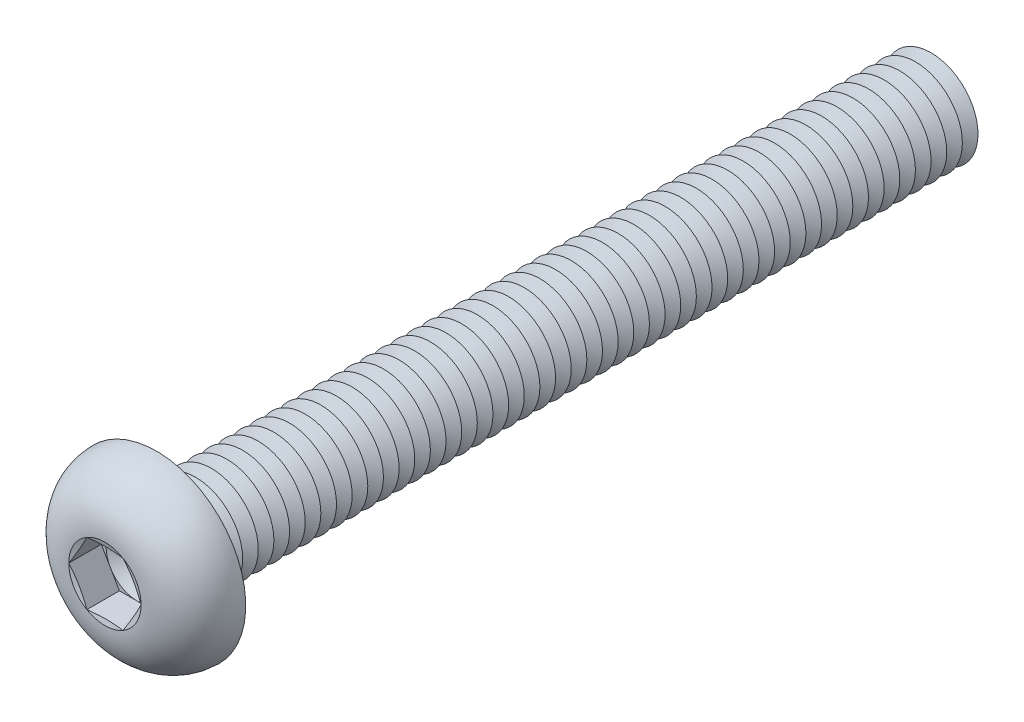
ISO-10303-21;
HEADER;
FILE_DESCRIPTION(('STEP AP214'),'2;1');
FILE_NAME('part.step','',(''),(''),'','','');
FILE_SCHEMA(('AUTOMOTIVE_DESIGN { 1 0 10303 214 1 1 1 1 }'));
ENDSEC;
DATA;
#1=APPLICATION_CONTEXT('core data for automotive mechanical design processes');
#2=APPLICATION_PROTOCOL_DEFINITION('international standard','automotive_design',2000,#1);
#3=PRODUCT_CONTEXT('',#1,'mechanical');
#4=PRODUCT('Part','Part','',(#3));
#5=PRODUCT_RELATED_PRODUCT_CATEGORY('part','',(#4));
#6=PRODUCT_DEFINITION_FORMATION('','',#4);
#7=PRODUCT_DEFINITION_CONTEXT('part definition',#1,'design');
#8=PRODUCT_DEFINITION('design','',#6,#7);
#9=PRODUCT_DEFINITION_SHAPE('','',#8);
#10=(LENGTH_UNIT() NAMED_UNIT(*) SI_UNIT(.MILLI.,.METRE.));
#11=(NAMED_UNIT(*) PLANE_ANGLE_UNIT() SI_UNIT($,.RADIAN.));
#12=(NAMED_UNIT(*) SI_UNIT($,.STERADIAN.) SOLID_ANGLE_UNIT());
#13=UNCERTAINTY_MEASURE_WITH_UNIT(LENGTH_MEASURE(1.E-05),#10,'distance_accuracy_value','');
#14=(GEOMETRIC_REPRESENTATION_CONTEXT(3) GLOBAL_UNCERTAINTY_ASSIGNED_CONTEXT((#13)) GLOBAL_UNIT_ASSIGNED_CONTEXT((#10,
#11,#12)) REPRESENTATION_CONTEXT('',''));
#15=CARTESIAN_POINT('',(0.,0.,0.));
#16=DIRECTION('',(0.,0.,1.));
#17=DIRECTION('',(1.,0.,0.));
#18=AXIS2_PLACEMENT_3D('',#15,#16,#17);
#19=CARTESIAN_POINT('',(0.,0.,0.609999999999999));
#20=DIRECTION('',(0.,0.,1.));
#21=DIRECTION('',(1.,0.,0.));
#22=AXIS2_PLACEMENT_3D('',#19,#20,#21);
#23=PLANE('',#22);
#24=CARTESIAN_POINT('',(0.,0.,0.609999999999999));
#25=DIRECTION('',(0.,0.,1.));
#26=DIRECTION('',(1.,0.,0.));
#27=AXIS2_PLACEMENT_3D('',#24,#25,#26);
#28=CIRCLE('',#27,0.999999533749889);
#29=CARTESIAN_POINT('',(0.866024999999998,0.499999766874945,0.609999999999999));
#30=VERTEX_POINT('',#29);
#31=CARTESIAN_POINT('',(0.,0.999999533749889,0.609999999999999));
#32=VERTEX_POINT('',#31);
#33=EDGE_CURVE('E118',#30,#32,#28,.T.);
#34=ORIENTED_EDGE('',*,*,#33,.F.);
#35=DIRECTION('',(-0.500000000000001,0.866025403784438,0.));
#36=VECTOR('',#35,1.);
#37=CARTESIAN_POINT('',(1.1547,0.,0.609999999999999));
#38=LINE('',#37,#36);
#39=CARTESIAN_POINT('',(0.577349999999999,0.999999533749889,0.609999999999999));
#40=VERTEX_POINT('',#39);
#41=EDGE_CURVE('E125',#30,#40,#38,.T.);
#42=ORIENTED_EDGE('',*,*,#41,.T.);
#43=DIRECTION('',(-1.,0.,0.));
#44=VECTOR('',#43,1.);
#45=CARTESIAN_POINT('',(0.577349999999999,0.999999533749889,0.609999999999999));
#46=LINE('',#45,#44);
#47=EDGE_CURVE('E136',#40,#32,#46,.T.);
#48=ORIENTED_EDGE('',*,*,#47,.T.);
#49=EDGE_LOOP('',(#34,#42,#48));
#50=FACE_BOUND('',#49,.T.);
#51=ADVANCED_FACE('F39',(#50),#23,.T.);
#52=CARTESIAN_POINT('',(0.,0.,0.609999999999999));
#53=DIRECTION('',(0.,0.,1.));
#54=DIRECTION('',(1.,0.,0.));
#55=AXIS2_PLACEMENT_3D('',#52,#53,#54);
#56=CIRCLE('',#55,0.999999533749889);
#57=CARTESIAN_POINT('',(-0.866024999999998,0.499999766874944,0.609999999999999));
#58=VERTEX_POINT('',#57);
#59=EDGE_CURVE('E11',#32,#58,#56,.T.);
#60=ORIENTED_EDGE('',*,*,#59,.F.);
#61=CARTESIAN_POINT('',(-0.577350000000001,0.999999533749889,0.609999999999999));
#62=VERTEX_POINT('',#61);
#63=EDGE_CURVE('E131',#32,#62,#46,.T.);
#64=ORIENTED_EDGE('',*,*,#63,.T.);
#65=DIRECTION('',(-0.5,-0.866025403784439,0.));
#66=VECTOR('',#65,1.);
#67=CARTESIAN_POINT('',(-0.577350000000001,0.999999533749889,0.609999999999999));
#68=LINE('',#67,#66);
#69=EDGE_CURVE('E134',#62,#58,#68,.T.);
#70=ORIENTED_EDGE('',*,*,#69,.T.);
#71=EDGE_LOOP('',(#60,#64,#70));
#72=FACE_BOUND('',#71,.T.);
#73=ADVANCED_FACE('F130',(#72),#23,.T.);
#74=CARTESIAN_POINT('',(-0.866024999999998,-0.499999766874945,0.609999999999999));
#75=VERTEX_POINT('',#74);
#76=EDGE_CURVE('E49',#58,#75,#56,.T.);
#77=ORIENTED_EDGE('',*,*,#76,.F.);
#78=CARTESIAN_POINT('',(-1.1547,0.,0.609999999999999));
#79=VERTEX_POINT('',#78);
#80=EDGE_CURVE('E143',#58,#79,#68,.T.);
#81=ORIENTED_EDGE('',*,*,#80,.T.);
#82=DIRECTION('',(0.5,-0.866025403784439,0.));
#83=VECTOR('',#82,1.);
#84=CARTESIAN_POINT('',(-1.1547,0.,0.609999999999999));
#85=LINE('',#84,#83);
#86=EDGE_CURVE('E152',#79,#75,#85,.T.);
#87=ORIENTED_EDGE('',*,*,#86,.T.);
#88=EDGE_LOOP('',(#77,#81,#87));
#89=FACE_BOUND('',#88,.T.);
#90=ADVANCED_FACE('F668',(#89),#23,.T.);
#91=CARTESIAN_POINT('',(0.,-0.999999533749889,0.609999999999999));
#92=VERTEX_POINT('',#91);
#93=EDGE_CURVE('E651',#75,#92,#56,.T.);
#94=ORIENTED_EDGE('',*,*,#93,.F.);
#95=CARTESIAN_POINT('',(-0.577349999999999,-0.99999953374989,0.609999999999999));
#96=VERTEX_POINT('',#95);
#97=EDGE_CURVE('E151',#75,#96,#85,.T.);
#98=ORIENTED_EDGE('',*,*,#97,.T.);
#99=DIRECTION('',(1.,0.,0.));
#100=VECTOR('',#99,1.);
#101=CARTESIAN_POINT('',(-0.577349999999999,-0.99999953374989,0.609999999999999));
#102=LINE('',#101,#100);
#103=EDGE_CURVE('E157',#96,#92,#102,.T.);
#104=ORIENTED_EDGE('',*,*,#103,.T.);
#105=EDGE_LOOP('',(#94,#98,#104));
#106=FACE_BOUND('',#105,.T.);
#107=ADVANCED_FACE('F661',(#106),#23,.T.);
#108=CARTESIAN_POINT('',(0.866024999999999,-0.499999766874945,0.609999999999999));
#109=VERTEX_POINT('',#108);
#110=EDGE_CURVE('E56',#92,#109,#56,.T.);
#111=ORIENTED_EDGE('',*,*,#110,.F.);
#112=CARTESIAN_POINT('',(0.577349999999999,-0.99999953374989,0.609999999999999));
#113=VERTEX_POINT('',#112);
#114=EDGE_CURVE('E156',#92,#113,#102,.T.);
#115=ORIENTED_EDGE('',*,*,#114,.T.);
#116=DIRECTION('',(0.5,0.866025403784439,0.));
#117=VECTOR('',#116,1.);
#118=CARTESIAN_POINT('',(0.577349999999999,-0.99999953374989,0.609999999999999));
#119=LINE('',#118,#117);
#120=EDGE_CURVE('E162',#113,#109,#119,.T.);
#121=ORIENTED_EDGE('',*,*,#120,.T.);
#122=EDGE_LOOP('',(#111,#115,#121));
#123=FACE_BOUND('',#122,.T.);
#124=ADVANCED_FACE('F748',(#123),#23,.T.);
#125=CARTESIAN_POINT('',(0.,0.,1.65));
#126=DIRECTION('',(0.,0.,1.));
#127=DIRECTION('',(1.,0.,0.));
#128=AXIS2_PLACEMENT_3D('',#125,#126,#127);
#129=CONICAL_SURFACE('',#128,1.1547,1.30899693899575);
#130=CARTESIAN_POINT('',(1.15481547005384,-0.000199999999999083,1.65003094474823));
#131=CARTESIAN_POINT('',(1.13083002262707,0.0413440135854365,1.64359970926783));
#132=CARTESIAN_POINT('',(1.10680107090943,0.0829633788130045,1.63776108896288));
#133=CARTESIAN_POINT('',(1.05865826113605,0.166349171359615,1.62750303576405));
#134=CARTESIAN_POINT('',(1.03454437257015,0.208115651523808,1.62308418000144));
#135=CARTESIAN_POINT('',(0.986377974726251,0.291542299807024,1.61592375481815));
#136=CARTESIAN_POINT('',(0.962325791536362,0.333201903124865,1.61317364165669));
#137=CARTESIAN_POINT('',(0.914190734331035,0.416574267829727,1.60948600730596));
#138=CARTESIAN_POINT('',(0.890107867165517,0.458287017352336,1.60854813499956));
#139=CARTESIAN_POINT('',(0.841942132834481,0.541712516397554,1.60854813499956));
#140=CARTESIAN_POINT('',(0.817859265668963,0.583425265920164,1.60948600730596));
#141=CARTESIAN_POINT('',(0.769724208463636,0.666797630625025,1.61317364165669));
#142=CARTESIAN_POINT('',(0.745672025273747,0.708457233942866,1.61592375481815));
#143=CARTESIAN_POINT('',(0.697505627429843,0.791883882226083,1.62308418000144));
#144=CARTESIAN_POINT('',(0.673391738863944,0.833650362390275,1.62750303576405));
#145=CARTESIAN_POINT('',(0.625248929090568,0.917036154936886,1.63776108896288));
#146=CARTESIAN_POINT('',(0.60121997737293,0.958655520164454,1.64359970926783));
#147=CARTESIAN_POINT('',(0.577234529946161,1.00019953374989,1.65003094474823));
#148=B_SPLINE_CURVE_WITH_KNOTS('',3,(#130,#131,#132,#133,#134,#135,#136,#137,#138,#139,#140,
#141,#142,#143,#144,#145,#146,#147),.UNSPECIFIED.,.F.,.F.,(4,2,2,2,2,2,2,2,4),(0.,
0.145207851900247,0.290474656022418,0.434991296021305,0.579479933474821,0.723968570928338,
0.868485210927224,1.0137520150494,1.15895986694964),.UNSPECIFIED.);
#149=CARTESIAN_POINT('',(1.1547,0.,1.65));
#150=VERTEX_POINT('',#149);
#151=CARTESIAN_POINT('',(0.57735,0.99999953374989,1.65));
#152=VERTEX_POINT('',#151);
#153=EDGE_CURVE('E221',#150,#152,#148,.T.);
#154=ORIENTED_EDGE('',*,*,#153,.F.);
#155=CARTESIAN_POINT('',(0.,0.,1.65));
#156=DIRECTION('',(0.,0.,-1.));
#157=DIRECTION('',(-1.,0.,0.));
#158=AXIS2_PLACEMENT_3D('',#155,#156,#157);
#159=CIRCLE('',#158,1.1547);
#160=EDGE_CURVE('E698',#152,#150,#159,.T.);
#161=ORIENTED_EDGE('',*,*,#160,.F.);
#162=EDGE_LOOP('',(#154,#161));
#163=FACE_BOUND('',#162,.T.);
#164=ADVANCED_FACE('F712',(#163),#129,.F.);
#165=CARTESIAN_POINT('',(0.577234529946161,-1.00019953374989,1.65003094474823));
#166=CARTESIAN_POINT('',(0.60121997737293,-0.958655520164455,1.64359970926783));
#167=CARTESIAN_POINT('',(0.625248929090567,-0.917036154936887,1.63776108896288));
#168=CARTESIAN_POINT('',(0.673391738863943,-0.833650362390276,1.62750303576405));
#169=CARTESIAN_POINT('',(0.697505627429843,-0.791883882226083,1.62308418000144));
#170=CARTESIAN_POINT('',(0.745672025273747,-0.708457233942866,1.61592375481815));
#171=CARTESIAN_POINT('',(0.769724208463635,-0.666797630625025,1.61317364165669));
#172=CARTESIAN_POINT('',(0.817859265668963,-0.583425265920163,1.60948600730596));
#173=CARTESIAN_POINT('',(0.84194213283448,-0.541712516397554,1.60854813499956));
#174=CARTESIAN_POINT('',(0.890107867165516,-0.458287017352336,1.60854813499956));
#175=CARTESIAN_POINT('',(0.914190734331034,-0.416574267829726,1.60948600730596));
#176=CARTESIAN_POINT('',(0.962325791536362,-0.333201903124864,1.61317364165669));
#177=CARTESIAN_POINT('',(0.98637797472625,-0.291542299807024,1.61592375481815));
#178=CARTESIAN_POINT('',(1.03454437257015,-0.208115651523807,1.62308418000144));
#179=CARTESIAN_POINT('',(1.05865826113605,-0.166349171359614,1.62750303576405));
#180=CARTESIAN_POINT('',(1.10680107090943,-0.0829633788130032,1.63776108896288));
#181=CARTESIAN_POINT('',(1.13083002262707,-0.0413440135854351,1.64359970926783));
#182=CARTESIAN_POINT('',(1.15481547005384,0.000200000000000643,1.65003094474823));
#183=B_SPLINE_CURVE_WITH_KNOTS('',3,(#165,#166,#167,#168,#169,#170,#171,#172,#173,#174,#175,
#176,#177,#178,#179,#180,#181,#182),.UNSPECIFIED.,.F.,.F.,(4,2,2,2,2,2,2,2,4),(0.,
0.145207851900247,0.290474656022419,0.434991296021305,0.579479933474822,0.723968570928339,
0.868485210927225,1.0137520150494,1.15895986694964),.UNSPECIFIED.);
#184=CARTESIAN_POINT('',(0.577349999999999,-0.99999953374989,1.65));
#185=VERTEX_POINT('',#184);
#186=EDGE_CURVE('E230',#185,#150,#183,.T.);
#187=ORIENTED_EDGE('',*,*,#186,.F.);
#188=EDGE_CURVE('E700',#150,#185,#159,.T.);
#189=ORIENTED_EDGE('',*,*,#188,.F.);
#190=EDGE_LOOP('',(#187,#189));
#191=FACE_BOUND('',#190,.T.);
#192=ADVANCED_FACE('F715',(#191),#129,.F.);
#193=CARTESIAN_POINT('',(-1.7425668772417,-0.99999953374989,1.87893949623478));
#194=CARTESIAN_POINT('',(-1.65819693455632,-0.99999953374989,1.85935934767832));
#195=CARTESIAN_POINT('',(-1.57375647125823,-0.99999953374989,1.84006351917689));
#196=CARTESIAN_POINT('',(-1.40464514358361,-0.99999953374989,1.80242908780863));
#197=CARTESIAN_POINT('',(-1.31997423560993,-0.99999953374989,1.78409068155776));
#198=CARTESIAN_POINT('',(-1.14955192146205,-0.99999953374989,1.74860242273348));
#199=CARTESIAN_POINT('',(-1.06379782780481,-0.99999953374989,1.73146532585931));
#200=CARTESIAN_POINT('',(-0.891887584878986,-0.99999953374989,1.69925819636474));
#201=CARTESIAN_POINT('',(-0.805731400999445,-0.99999953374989,1.68418834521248));
#202=CARTESIAN_POINT('',(-0.635256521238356,-0.99999953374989,1.65751615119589));
#203=CARTESIAN_POINT('',(-0.550951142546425,-0.99999953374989,1.64583105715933));
#204=CARTESIAN_POINT('',(-0.381865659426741,-0.99999953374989,1.62668811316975));
#205=CARTESIAN_POINT('',(-0.297085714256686,-0.99999953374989,1.61922892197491));
#206=CARTESIAN_POINT('',(-0.127577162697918,-0.99999953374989,1.60981453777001));
#207=CARTESIAN_POINT('',(-0.0428499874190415,-0.99999953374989,1.60783514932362));
#208=CARTESIAN_POINT('',(0.126542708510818,-0.99999953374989,1.60973012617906));
#209=CARTESIAN_POINT('',(0.211208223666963,-0.99999953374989,1.61360496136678));
#210=CARTESIAN_POINT('',(0.356115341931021,-0.99999953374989,1.62460226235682));
#211=CARTESIAN_POINT('',(0.416458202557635,-0.99999953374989,1.63048841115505));
#212=CARTESIAN_POINT('',(0.536893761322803,-0.99999953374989,1.64437752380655));
#213=CARTESIAN_POINT('',(0.596986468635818,-0.99999953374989,1.65238040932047));
#214=CARTESIAN_POINT('',(0.777275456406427,-0.99999953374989,1.67888855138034));
#215=CARTESIAN_POINT('',(0.897104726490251,-0.99999953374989,1.69985858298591));
#216=CARTESIAN_POINT('',(1.07751611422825,-0.99999953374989,1.73433574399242));
#217=CARTESIAN_POINT('',(1.1383777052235,-0.99999953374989,1.74646914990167));
#218=CARTESIAN_POINT('',(1.25994955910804,-0.99999953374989,1.7714845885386));
#219=CARTESIAN_POINT('',(1.32065982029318,-0.99999953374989,1.7843666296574));
#220=CARTESIAN_POINT('',(1.44162663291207,-0.99999953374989,1.81062164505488));
#221=CARTESIAN_POINT('',(1.50188385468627,-0.99999953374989,1.82399156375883));
#222=CARTESIAN_POINT('',(1.62229550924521,-0.99999953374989,1.85116781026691));
#223=CARTESIAN_POINT('',(1.68244994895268,-0.99999953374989,1.86497410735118));
#224=CARTESIAN_POINT('',(1.7425668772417,-0.99999953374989,1.87893949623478));
#225=B_SPLINE_CURVE_WITH_KNOTS('',3,(#193,#194,#195,#196,#197,#198,#199,#200,#201,#202,#203,
#204,#205,#206,#207,#208,#209,#210,#211,#212,#213,#214,#215,#216,#217,#218,#219,#220,#221,#222,
#223,#224),.UNSPECIFIED.,.F.,.F.,(4,2,2,2,2,2,2,2,2,2,2,2,2,2,2,4),(0.,0.259842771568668,
0.519738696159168,0.782071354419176,1.04442702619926,1.29968778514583,1.55486748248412,
1.80891865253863,2.06299021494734,2.24483732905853,2.42667771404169,2.79149503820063,
2.97767344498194,3.16385393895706,3.34902052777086,3.53417411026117),.UNSPECIFIED.);
#226=CARTESIAN_POINT('',(-0.577349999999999,-0.99999953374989,1.65));
#227=VERTEX_POINT('',#226);
#228=EDGE_CURVE('E679',#227,#185,#225,.T.);
#229=ORIENTED_EDGE('',*,*,#228,.F.);
#230=EDGE_CURVE('E687',#185,#227,#159,.T.);
#231=ORIENTED_EDGE('',*,*,#230,.F.);
#232=EDGE_LOOP('',(#229,#231));
#233=FACE_BOUND('',#232,.T.);
#234=ADVANCED_FACE('F720',(#233),#129,.F.);
#235=CARTESIAN_POINT('',(-1.15481547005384,0.000200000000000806,1.65003094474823));
#236=CARTESIAN_POINT('',(-1.13083002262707,-0.041344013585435,1.64359970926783));
#237=CARTESIAN_POINT('',(-1.10680107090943,-0.0829633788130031,1.63776108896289));
#238=CARTESIAN_POINT('',(-1.05865826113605,-0.166349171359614,1.62750303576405));
#239=CARTESIAN_POINT('',(-1.03454437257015,-0.208115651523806,1.62308418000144));
#240=CARTESIAN_POINT('',(-0.986377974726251,-0.291542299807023,1.61592375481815));
#241=CARTESIAN_POINT('',(-0.962325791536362,-0.333201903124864,1.61317364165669));
#242=CARTESIAN_POINT('',(-0.914190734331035,-0.416574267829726,1.60948600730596));
#243=CARTESIAN_POINT('',(-0.890107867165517,-0.458287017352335,1.60854813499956));
#244=CARTESIAN_POINT('',(-0.841942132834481,-0.541712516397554,1.60854813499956));
#245=CARTESIAN_POINT('',(-0.817859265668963,-0.583425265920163,1.60948600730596));
#246=CARTESIAN_POINT('',(-0.769724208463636,-0.666797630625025,1.61317364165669));
#247=CARTESIAN_POINT('',(-0.745672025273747,-0.708457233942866,1.61592375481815));
#248=CARTESIAN_POINT('',(-0.697505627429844,-0.791883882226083,1.62308418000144));
#249=CARTESIAN_POINT('',(-0.673391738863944,-0.833650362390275,1.62750303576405));
#250=CARTESIAN_POINT('',(-0.625248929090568,-0.917036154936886,1.63776108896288));
#251=CARTESIAN_POINT('',(-0.60121997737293,-0.958655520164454,1.64359970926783));
#252=CARTESIAN_POINT('',(-0.577234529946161,-1.00019953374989,1.65003094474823));
#253=B_SPLINE_CURVE_WITH_KNOTS('',3,(#235,#236,#237,#238,#239,#240,#241,#242,#243,#244,#245,
#246,#247,#248,#249,#250,#251,#252),.UNSPECIFIED.,.F.,.F.,(4,2,2,2,2,2,2,2,4),(0.,
0.145207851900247,0.290474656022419,0.434991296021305,0.579479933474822,0.723968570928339,
0.868485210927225,1.0137520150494,1.15895986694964),.UNSPECIFIED.);
#254=CARTESIAN_POINT('',(-1.1547,0.,1.65));
#255=VERTEX_POINT('',#254);
#256=EDGE_CURVE('E673',#255,#227,#253,.T.);
#257=ORIENTED_EDGE('',*,*,#256,.F.);
#258=EDGE_CURVE('E634',#227,#255,#159,.T.);
#259=ORIENTED_EDGE('',*,*,#258,.F.);
#260=EDGE_LOOP('',(#257,#259));
#261=FACE_BOUND('',#260,.T.);
#262=ADVANCED_FACE('F677',(#261),#129,.F.);
#263=CARTESIAN_POINT('',(-0.577234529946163,1.00019953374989,1.65003094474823));
#264=CARTESIAN_POINT('',(-0.601219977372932,0.958655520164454,1.64359970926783));
#265=CARTESIAN_POINT('',(-0.625248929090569,0.917036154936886,1.63776108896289));
#266=CARTESIAN_POINT('',(-0.673391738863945,0.833650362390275,1.62750303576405));
#267=CARTESIAN_POINT('',(-0.697505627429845,0.791883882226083,1.62308418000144));
#268=CARTESIAN_POINT('',(-0.745672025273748,0.708457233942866,1.61592375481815));
#269=CARTESIAN_POINT('',(-0.769724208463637,0.666797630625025,1.61317364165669));
#270=CARTESIAN_POINT('',(-0.817859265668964,0.583425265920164,1.60948600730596));
#271=CARTESIAN_POINT('',(-0.841942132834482,0.541712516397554,1.60854813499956));
#272=CARTESIAN_POINT('',(-0.890107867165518,0.458287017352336,1.60854813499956));
#273=CARTESIAN_POINT('',(-0.914190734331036,0.416574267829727,1.60948600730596));
#274=CARTESIAN_POINT('',(-0.962325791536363,0.333201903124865,1.61317364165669));
#275=CARTESIAN_POINT('',(-0.986377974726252,0.291542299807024,1.61592375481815));
#276=CARTESIAN_POINT('',(-1.03454437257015,0.208115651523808,1.62308418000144));
#277=CARTESIAN_POINT('',(-1.05865826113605,0.166349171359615,1.62750303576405));
#278=CARTESIAN_POINT('',(-1.10680107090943,0.0829633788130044,1.63776108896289));
#279=CARTESIAN_POINT('',(-1.13083002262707,0.0413440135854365,1.64359970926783));
#280=CARTESIAN_POINT('',(-1.15481547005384,-0.000199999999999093,1.65003094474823));
#281=B_SPLINE_CURVE_WITH_KNOTS('',3,(#263,#264,#265,#266,#267,#268,#269,#270,#271,#272,#273,
#274,#275,#276,#277,#278,#279,#280),.UNSPECIFIED.,.F.,.F.,(4,2,2,2,2,2,2,2,4),(0.,
0.145207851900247,0.290474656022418,0.434991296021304,0.579479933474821,0.723968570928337,
0.868485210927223,1.01375201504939,1.15895986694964),.UNSPECIFIED.);
#282=CARTESIAN_POINT('',(-0.577350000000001,0.999999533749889,1.65));
#283=VERTEX_POINT('',#282);
#284=EDGE_CURVE('E195',#283,#255,#281,.T.);
#285=ORIENTED_EDGE('',*,*,#284,.F.);
#286=EDGE_CURVE('E635',#255,#283,#159,.T.);
#287=ORIENTED_EDGE('',*,*,#286,.F.);
#288=EDGE_LOOP('',(#285,#287));
#289=FACE_BOUND('',#288,.T.);
#290=ADVANCED_FACE('F690',(#289),#129,.F.);
#291=CARTESIAN_POINT('',(0.,0.,-23.25));
#292=DIRECTION('',(0.,0.,1.));
#293=DIRECTION('',(1.,0.,0.));
#294=AXIS2_PLACEMENT_3D('',#291,#292,#293);
#295=CONICAL_SURFACE('',#294,1.50000000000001,1.0471975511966);
#296=CARTESIAN_POINT('',(0.,0.,-23.5));
#297=DIRECTION('',(0.,0.,1.));
#298=DIRECTION('',(1.,0.,0.));
#299=AXIS2_PLACEMENT_3D('',#296,#297,#298);
#300=CIRCLE('',#299,1.06698729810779);
#301=CARTESIAN_POINT('',(1.06698729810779,0.,-23.5));
#302=VERTEX_POINT('',#301);
#303=EDGE_CURVE('E606',#302,#302,#300,.T.);
#304=ORIENTED_EDGE('',*,*,#303,.T.);
#305=EDGE_LOOP('',(#304));
#306=FACE_BOUND('',#305,.T.);
#307=CARTESIAN_POINT('',(0.,0.,-23.25));
#308=DIRECTION('',(0.,0.,1.));
#309=DIRECTION('',(1.,0.,0.));
#310=AXIS2_PLACEMENT_3D('',#307,#308,#309);
#311=CIRCLE('',#310,1.50000000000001);
#312=CARTESIAN_POINT('',(1.50000000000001,0.,-23.25));
#313=VERTEX_POINT('',#312);
#314=EDGE_CURVE('E602',#313,#313,#311,.T.);
#315=ORIENTED_EDGE('',*,*,#314,.F.);
#316=EDGE_LOOP('',(#315));
#317=FACE_BOUND('',#316,.T.);
#318=ADVANCED_FACE('F878',(#306,#317),#295,.T.);
#319=CARTESIAN_POINT('',(0.,0.,-23.5));
#320=DIRECTION('',(0.,0.,-1.));
#321=DIRECTION('',(-1.,0.,0.));
#322=AXIS2_PLACEMENT_3D('',#319,#320,#321);
#323=CONICAL_SURFACE('',#322,1.06698729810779,1.0471975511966);
#324=CARTESIAN_POINT('',(0.,0.,-23.75));
#325=DIRECTION('',(0.,0.,1.));
#326=DIRECTION('',(1.,0.,0.));
#327=AXIS2_PLACEMENT_3D('',#324,#325,#326);
#328=CIRCLE('',#327,1.50000000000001);
#329=CARTESIAN_POINT('',(1.50000000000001,0.,-23.75));
#330=VERTEX_POINT('',#329);
#331=EDGE_CURVE('E610',#330,#330,#328,.T.);
#332=ORIENTED_EDGE('',*,*,#331,.T.);
#333=EDGE_LOOP('',(#332));
#334=FACE_BOUND('',#333,.T.);
#335=ORIENTED_EDGE('',*,*,#303,.F.);
#336=EDGE_LOOP('',(#335));
#337=FACE_BOUND('',#336,.T.);
#338=ADVANCED_FACE('F1840',(#334,#337),#323,.T.);
#339=CARTESIAN_POINT('',(0.,1.50000000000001,-25.));
#340=DIRECTION('',(0.,0.,-1.));
#341=DIRECTION('',(-1.,0.,0.));
#342=AXIS2_PLACEMENT_3D('',#339,#340,#341);
#343=PLANE('',#342);
#344=CARTESIAN_POINT('',(0.,0.,-25.));
#345=DIRECTION('',(0.,0.,1.));
#346=DIRECTION('',(1.,0.,0.));
#347=AXIS2_PLACEMENT_3D('',#344,#345,#346);
#348=CIRCLE('',#347,1.06698729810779);
#349=CARTESIAN_POINT('',(1.06698729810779,0.,-25.));
#350=VERTEX_POINT('',#349);
#351=EDGE_CURVE('E630',#350,#350,#348,.T.);
#352=ORIENTED_EDGE('',*,*,#351,.F.);
#353=EDGE_LOOP('',(#352));
#354=FACE_BOUND('',#353,.T.);
#355=ADVANCED_FACE('F1845',(#354),#343,.T.);
#356=CARTESIAN_POINT('',(0.,0.,-24.75));
#357=DIRECTION('',(0.,0.,1.));
#358=DIRECTION('',(1.,0.,0.));
#359=AXIS2_PLACEMENT_3D('',#356,#357,#358);
#360=CONICAL_SURFACE('',#359,1.50000000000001,1.0471975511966);
#361=ORIENTED_EDGE('',*,*,#351,.T.);
#362=EDGE_LOOP('',(#361));
#363=FACE_BOUND('',#362,.T.);
#364=CARTESIAN_POINT('',(0.,0.,-24.75));
#365=DIRECTION('',(0.,0.,1.));
#366=DIRECTION('',(1.,0.,0.));
#367=AXIS2_PLACEMENT_3D('',#364,#365,#366);
#368=CIRCLE('',#367,1.50000000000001);
#369=CARTESIAN_POINT('',(1.50000000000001,0.,-24.75));
#370=VERTEX_POINT('',#369);
#371=EDGE_CURVE('E626',#370,#370,#368,.T.);
#372=ORIENTED_EDGE('',*,*,#371,.F.);
#373=EDGE_LOOP('',(#372));
#374=FACE_BOUND('',#373,.T.);
#375=ADVANCED_FACE('F1834',(#363,#374),#360,.T.);
#376=CARTESIAN_POINT('',(0.,0.,-24.5));
#377=DIRECTION('',(0.,0.,-1.));
#378=DIRECTION('',(-1.,0.,0.));
#379=AXIS2_PLACEMENT_3D('',#376,#377,#378);
#380=CONICAL_SURFACE('',#379,1.06698729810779,1.0471975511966);
#381=ORIENTED_EDGE('',*,*,#371,.T.);
#382=EDGE_LOOP('',(#381));
#383=FACE_BOUND('',#382,.T.);
#384=CARTESIAN_POINT('',(0.,0.,-24.5));
#385=DIRECTION('',(0.,0.,1.));
#386=DIRECTION('',(1.,0.,0.));
#387=AXIS2_PLACEMENT_3D('',#384,#385,#386);
#388=CIRCLE('',#387,1.06698729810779);
#389=CARTESIAN_POINT('',(1.06698729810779,0.,-24.5));
#390=VERTEX_POINT('',#389);
#391=EDGE_CURVE('E622',#390,#390,#388,.T.);
#392=ORIENTED_EDGE('',*,*,#391,.F.);
#393=EDGE_LOOP('',(#392));
#394=FACE_BOUND('',#393,.T.);
#395=ADVANCED_FACE('F1824',(#383,#394),#380,.T.);
#396=CARTESIAN_POINT('',(0.,0.,-24.25));
#397=DIRECTION('',(0.,0.,1.));
#398=DIRECTION('',(1.,0.,0.));
#399=AXIS2_PLACEMENT_3D('',#396,#397,#398);
#400=CONICAL_SURFACE('',#399,1.50000000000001,1.0471975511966);
#401=ORIENTED_EDGE('',*,*,#391,.T.);
#402=EDGE_LOOP('',(#401));
#403=FACE_BOUND('',#402,.T.);
#404=CARTESIAN_POINT('',(0.,0.,-24.25));
#405=DIRECTION('',(0.,0.,1.));
#406=DIRECTION('',(1.,0.,0.));
#407=AXIS2_PLACEMENT_3D('',#404,#405,#406);
#408=CIRCLE('',#407,1.50000000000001);
#409=CARTESIAN_POINT('',(1.50000000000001,0.,-24.25));
#410=VERTEX_POINT('',#409);
#411=EDGE_CURVE('E618',#410,#410,#408,.T.);
#412=ORIENTED_EDGE('',*,*,#411,.F.);
#413=EDGE_LOOP('',(#412));
#414=FACE_BOUND('',#413,.T.);
#415=ADVANCED_FACE('F1814',(#403,#414),#400,.T.);
#416=CARTESIAN_POINT('',(0.,0.,-24.));
#417=DIRECTION('',(0.,0.,-1.));
#418=DIRECTION('',(-1.,0.,0.));
#419=AXIS2_PLACEMENT_3D('',#416,#417,#418);
#420=CONICAL_SURFACE('',#419,1.06698729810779,1.0471975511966);
#421=ORIENTED_EDGE('',*,*,#411,.T.);
#422=EDGE_LOOP('',(#421));
#423=FACE_BOUND('',#422,.T.);
#424=CARTESIAN_POINT('',(0.,0.,-24.));
#425=DIRECTION('',(0.,0.,1.));
#426=DIRECTION('',(1.,0.,0.));
#427=AXIS2_PLACEMENT_3D('',#424,#425,#426);
#428=CIRCLE('',#427,1.06698729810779);
#429=CARTESIAN_POINT('',(1.06698729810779,0.,-24.));
#430=VERTEX_POINT('',#429);
#431=EDGE_CURVE('E614',#430,#430,#428,.T.);
#432=ORIENTED_EDGE('',*,*,#431,.F.);
#433=EDGE_LOOP('',(#432));
#434=FACE_BOUND('',#433,.T.);
#435=ADVANCED_FACE('F1804',(#423,#434),#420,.T.);
#436=CARTESIAN_POINT('',(0.,0.,-23.75));
#437=DIRECTION('',(0.,0.,1.));
#438=DIRECTION('',(1.,0.,0.));
#439=AXIS2_PLACEMENT_3D('',#436,#437,#438);
#440=CONICAL_SURFACE('',#439,1.50000000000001,1.0471975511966);
#441=ORIENTED_EDGE('',*,*,#431,.T.);
#442=EDGE_LOOP('',(#441));
#443=FACE_BOUND('',#442,.T.);
#444=ORIENTED_EDGE('',*,*,#331,.F.);
#445=EDGE_LOOP('',(#444));
#446=FACE_BOUND('',#445,.T.);
#447=ADVANCED_FACE('F1794',(#443,#446),#440,.T.);
#448=CARTESIAN_POINT('',(0.,0.,-22.75));
#449=DIRECTION('',(0.,0.,1.));
#450=DIRECTION('',(1.,0.,0.));
#451=AXIS2_PLACEMENT_3D('',#448,#449,#450);
#452=CONICAL_SURFACE('',#451,1.50000000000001,1.0471975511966);
#453=CARTESIAN_POINT('',(0.,0.,-23.));
#454=DIRECTION('',(0.,0.,1.));
#455=DIRECTION('',(1.,0.,0.));
#456=AXIS2_PLACEMENT_3D('',#453,#454,#455);
#457=CIRCLE('',#456,1.06698729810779);
#458=CARTESIAN_POINT('',(1.06698729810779,0.,-23.));
#459=VERTEX_POINT('',#458);
#460=EDGE_CURVE('E599',#459,#459,#457,.T.);
#461=ORIENTED_EDGE('',*,*,#460,.T.);
#462=EDGE_LOOP('',(#461));
#463=FACE_BOUND('',#462,.T.);
#464=CARTESIAN_POINT('',(0.,0.,-22.75));
#465=DIRECTION('',(0.,0.,1.));
#466=DIRECTION('',(1.,0.,0.));
#467=AXIS2_PLACEMENT_3D('',#464,#465,#466);
#468=CIRCLE('',#467,1.50000000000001);
#469=CARTESIAN_POINT('',(1.50000000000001,0.,-22.75));
#470=VERTEX_POINT('',#469);
#471=EDGE_CURVE('E595',#470,#470,#468,.T.);
#472=ORIENTED_EDGE('',*,*,#471,.F.);
#473=EDGE_LOOP('',(#472));
#474=FACE_BOUND('',#473,.T.);
#475=ADVANCED_FACE('F1784',(#463,#474),#452,.T.);
#476=CARTESIAN_POINT('',(0.,0.,-23.));
#477=DIRECTION('',(0.,0.,-1.));
#478=DIRECTION('',(-1.,0.,0.));
#479=AXIS2_PLACEMENT_3D('',#476,#477,#478);
#480=CONICAL_SURFACE('',#479,1.06698729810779,1.0471975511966);
#481=ORIENTED_EDGE('',*,*,#314,.T.);
#482=EDGE_LOOP('',(#481));
#483=FACE_BOUND('',#482,.T.);
#484=ORIENTED_EDGE('',*,*,#460,.F.);
#485=EDGE_LOOP('',(#484));
#486=FACE_BOUND('',#485,.T.);
#487=ADVANCED_FACE('F1774',(#483,#486),#480,.T.);
#488=CARTESIAN_POINT('',(0.,0.,-22.25));
#489=DIRECTION('',(0.,0.,1.));
#490=DIRECTION('',(1.,0.,0.));
#491=AXIS2_PLACEMENT_3D('',#488,#489,#490);
#492=CONICAL_SURFACE('',#491,1.50000000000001,1.0471975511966);
#493=CARTESIAN_POINT('',(0.,0.,-22.5));
#494=DIRECTION('',(0.,0.,1.));
#495=DIRECTION('',(1.,0.,0.));
#496=AXIS2_PLACEMENT_3D('',#493,#494,#495);
#497=CIRCLE('',#496,1.06698729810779);
#498=CARTESIAN_POINT('',(1.06698729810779,0.,-22.5));
#499=VERTEX_POINT('',#498);
#500=EDGE_CURVE('E591',#499,#499,#497,.T.);
#501=ORIENTED_EDGE('',*,*,#500,.T.);
#502=EDGE_LOOP('',(#501));
#503=FACE_BOUND('',#502,.T.);
#504=CARTESIAN_POINT('',(0.,0.,-22.25));
#505=DIRECTION('',(0.,0.,1.));
#506=DIRECTION('',(1.,0.,0.));
#507=AXIS2_PLACEMENT_3D('',#504,#505,#506);
#508=CIRCLE('',#507,1.50000000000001);
#509=CARTESIAN_POINT('',(1.50000000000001,0.,-22.25));
#510=VERTEX_POINT('',#509);
#511=EDGE_CURVE('E587',#510,#510,#508,.T.);
#512=ORIENTED_EDGE('',*,*,#511,.F.);
#513=EDGE_LOOP('',(#512));
#514=FACE_BOUND('',#513,.T.);
#515=ADVANCED_FACE('F1764',(#503,#514),#492,.T.);
#516=CARTESIAN_POINT('',(0.,0.,-22.5));
#517=DIRECTION('',(0.,0.,-1.));
#518=DIRECTION('',(-1.,0.,0.));
#519=AXIS2_PLACEMENT_3D('',#516,#517,#518);
#520=CONICAL_SURFACE('',#519,1.06698729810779,1.0471975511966);
#521=ORIENTED_EDGE('',*,*,#471,.T.);
#522=EDGE_LOOP('',(#521));
#523=FACE_BOUND('',#522,.T.);
#524=ORIENTED_EDGE('',*,*,#500,.F.);
#525=EDGE_LOOP('',(#524));
#526=FACE_BOUND('',#525,.T.);
#527=ADVANCED_FACE('F1754',(#523,#526),#520,.T.);
#528=CARTESIAN_POINT('',(0.,0.,-21.75));
#529=DIRECTION('',(0.,0.,1.));
#530=DIRECTION('',(1.,0.,0.));
#531=AXIS2_PLACEMENT_3D('',#528,#529,#530);
#532=CONICAL_SURFACE('',#531,1.50000000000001,1.0471975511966);
#533=CARTESIAN_POINT('',(0.,0.,-22.));
#534=DIRECTION('',(0.,0.,1.));
#535=DIRECTION('',(1.,0.,0.));
#536=AXIS2_PLACEMENT_3D('',#533,#534,#535);
#537=CIRCLE('',#536,1.06698729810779);
#538=CARTESIAN_POINT('',(1.06698729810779,0.,-22.));
#539=VERTEX_POINT('',#538);
#540=EDGE_CURVE('E583',#539,#539,#537,.T.);
#541=ORIENTED_EDGE('',*,*,#540,.T.);
#542=EDGE_LOOP('',(#541));
#543=FACE_BOUND('',#542,.T.);
#544=CARTESIAN_POINT('',(0.,0.,-21.75));
#545=DIRECTION('',(0.,0.,1.));
#546=DIRECTION('',(1.,0.,0.));
#547=AXIS2_PLACEMENT_3D('',#544,#545,#546);
#548=CIRCLE('',#547,1.50000000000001);
#549=CARTESIAN_POINT('',(1.50000000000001,0.,-21.75));
#550=VERTEX_POINT('',#549);
#551=EDGE_CURVE('E579',#550,#550,#548,.T.);
#552=ORIENTED_EDGE('',*,*,#551,.F.);
#553=EDGE_LOOP('',(#552));
#554=FACE_BOUND('',#553,.T.);
#555=ADVANCED_FACE('F1744',(#543,#554),#532,.T.);
#556=CARTESIAN_POINT('',(0.,0.,-22.));
#557=DIRECTION('',(0.,0.,-1.));
#558=DIRECTION('',(-1.,0.,0.));
#559=AXIS2_PLACEMENT_3D('',#556,#557,#558);
#560=CONICAL_SURFACE('',#559,1.06698729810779,1.0471975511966);
#561=ORIENTED_EDGE('',*,*,#511,.T.);
#562=EDGE_LOOP('',(#561));
#563=FACE_BOUND('',#562,.T.);
#564=ORIENTED_EDGE('',*,*,#540,.F.);
#565=EDGE_LOOP('',(#564));
#566=FACE_BOUND('',#565,.T.);
#567=ADVANCED_FACE('F1734',(#563,#566),#560,.T.);
#568=CARTESIAN_POINT('',(0.,0.,-21.25));
#569=DIRECTION('',(0.,0.,1.));
#570=DIRECTION('',(1.,0.,0.));
#571=AXIS2_PLACEMENT_3D('',#568,#569,#570);
#572=CONICAL_SURFACE('',#571,1.50000000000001,1.0471975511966);
#573=CARTESIAN_POINT('',(0.,0.,-21.5));
#574=DIRECTION('',(0.,0.,1.));
#575=DIRECTION('',(1.,0.,0.));
#576=AXIS2_PLACEMENT_3D('',#573,#574,#575);
#577=CIRCLE('',#576,1.06698729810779);
#578=CARTESIAN_POINT('',(1.06698729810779,0.,-21.5));
#579=VERTEX_POINT('',#578);
#580=EDGE_CURVE('E575',#579,#579,#577,.T.);
#581=ORIENTED_EDGE('',*,*,#580,.T.);
#582=EDGE_LOOP('',(#581));
#583=FACE_BOUND('',#582,.T.);
#584=CARTESIAN_POINT('',(0.,0.,-21.25));
#585=DIRECTION('',(0.,0.,1.));
#586=DIRECTION('',(1.,0.,0.));
#587=AXIS2_PLACEMENT_3D('',#584,#585,#586);
#588=CIRCLE('',#587,1.50000000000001);
#589=CARTESIAN_POINT('',(1.50000000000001,0.,-21.25));
#590=VERTEX_POINT('',#589);
#591=EDGE_CURVE('E571',#590,#590,#588,.T.);
#592=ORIENTED_EDGE('',*,*,#591,.F.);
#593=EDGE_LOOP('',(#592));
#594=FACE_BOUND('',#593,.T.);
#595=ADVANCED_FACE('F1724',(#583,#594),#572,.T.);
#596=CARTESIAN_POINT('',(0.,0.,-21.5));
#597=DIRECTION('',(0.,0.,-1.));
#598=DIRECTION('',(-1.,0.,0.));
#599=AXIS2_PLACEMENT_3D('',#596,#597,#598);
#600=CONICAL_SURFACE('',#599,1.06698729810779,1.0471975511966);
#601=ORIENTED_EDGE('',*,*,#551,.T.);
#602=EDGE_LOOP('',(#601));
#603=FACE_BOUND('',#602,.T.);
#604=ORIENTED_EDGE('',*,*,#580,.F.);
#605=EDGE_LOOP('',(#604));
#606=FACE_BOUND('',#605,.T.);
#607=ADVANCED_FACE('F1714',(#603,#606),#600,.T.);
#608=CARTESIAN_POINT('',(0.,0.,-20.75));
#609=DIRECTION('',(0.,0.,1.));
#610=DIRECTION('',(1.,0.,0.));
#611=AXIS2_PLACEMENT_3D('',#608,#609,#610);
#612=CONICAL_SURFACE('',#611,1.50000000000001,1.0471975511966);
#613=CARTESIAN_POINT('',(0.,0.,-21.));
#614=DIRECTION('',(0.,0.,1.));
#615=DIRECTION('',(1.,0.,0.));
#616=AXIS2_PLACEMENT_3D('',#613,#614,#615);
#617=CIRCLE('',#616,1.06698729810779);
#618=CARTESIAN_POINT('',(1.06698729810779,0.,-21.));
#619=VERTEX_POINT('',#618);
#620=EDGE_CURVE('E567',#619,#619,#617,.T.);
#621=ORIENTED_EDGE('',*,*,#620,.T.);
#622=EDGE_LOOP('',(#621));
#623=FACE_BOUND('',#622,.T.);
#624=CARTESIAN_POINT('',(0.,0.,-20.75));
#625=DIRECTION('',(0.,0.,1.));
#626=DIRECTION('',(1.,0.,0.));
#627=AXIS2_PLACEMENT_3D('',#624,#625,#626);
#628=CIRCLE('',#627,1.50000000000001);
#629=CARTESIAN_POINT('',(1.50000000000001,0.,-20.75));
#630=VERTEX_POINT('',#629);
#631=EDGE_CURVE('E563',#630,#630,#628,.T.);
#632=ORIENTED_EDGE('',*,*,#631,.F.);
#633=EDGE_LOOP('',(#632));
#634=FACE_BOUND('',#633,.T.);
#635=ADVANCED_FACE('F1704',(#623,#634),#612,.T.);
#636=CARTESIAN_POINT('',(0.,0.,-21.));
#637=DIRECTION('',(0.,0.,-1.));
#638=DIRECTION('',(-1.,0.,0.));
#639=AXIS2_PLACEMENT_3D('',#636,#637,#638);
#640=CONICAL_SURFACE('',#639,1.06698729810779,1.0471975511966);
#641=ORIENTED_EDGE('',*,*,#591,.T.);
#642=EDGE_LOOP('',(#641));
#643=FACE_BOUND('',#642,.T.);
#644=ORIENTED_EDGE('',*,*,#620,.F.);
#645=EDGE_LOOP('',(#644));
#646=FACE_BOUND('',#645,.T.);
#647=ADVANCED_FACE('F1694',(#643,#646),#640,.T.);
#648=CARTESIAN_POINT('',(0.,0.,-20.25));
#649=DIRECTION('',(0.,0.,1.));
#650=DIRECTION('',(1.,0.,0.));
#651=AXIS2_PLACEMENT_3D('',#648,#649,#650);
#652=CONICAL_SURFACE('',#651,1.50000000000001,1.0471975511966);
#653=CARTESIAN_POINT('',(0.,0.,-20.5));
#654=DIRECTION('',(0.,0.,1.));
#655=DIRECTION('',(1.,0.,0.));
#656=AXIS2_PLACEMENT_3D('',#653,#654,#655);
#657=CIRCLE('',#656,1.06698729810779);
#658=CARTESIAN_POINT('',(1.06698729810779,0.,-20.5));
#659=VERTEX_POINT('',#658);
#660=EDGE_CURVE('E559',#659,#659,#657,.T.);
#661=ORIENTED_EDGE('',*,*,#660,.T.);
#662=EDGE_LOOP('',(#661));
#663=FACE_BOUND('',#662,.T.);
#664=CARTESIAN_POINT('',(0.,0.,-20.25));
#665=DIRECTION('',(0.,0.,1.));
#666=DIRECTION('',(1.,0.,0.));
#667=AXIS2_PLACEMENT_3D('',#664,#665,#666);
#668=CIRCLE('',#667,1.50000000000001);
#669=CARTESIAN_POINT('',(1.50000000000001,0.,-20.25));
#670=VERTEX_POINT('',#669);
#671=EDGE_CURVE('E555',#670,#670,#668,.T.);
#672=ORIENTED_EDGE('',*,*,#671,.F.);
#673=EDGE_LOOP('',(#672));
#674=FACE_BOUND('',#673,.T.);
#675=ADVANCED_FACE('F1684',(#663,#674),#652,.T.);
#676=CARTESIAN_POINT('',(0.,0.,-20.5));
#677=DIRECTION('',(0.,0.,-1.));
#678=DIRECTION('',(-1.,0.,0.));
#679=AXIS2_PLACEMENT_3D('',#676,#677,#678);
#680=CONICAL_SURFACE('',#679,1.06698729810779,1.0471975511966);
#681=ORIENTED_EDGE('',*,*,#631,.T.);
#682=EDGE_LOOP('',(#681));
#683=FACE_BOUND('',#682,.T.);
#684=ORIENTED_EDGE('',*,*,#660,.F.);
#685=EDGE_LOOP('',(#684));
#686=FACE_BOUND('',#685,.T.);
#687=ADVANCED_FACE('F1674',(#683,#686),#680,.T.);
#688=CARTESIAN_POINT('',(0.,0.,-19.75));
#689=DIRECTION('',(0.,0.,1.));
#690=DIRECTION('',(1.,0.,0.));
#691=AXIS2_PLACEMENT_3D('',#688,#689,#690);
#692=CONICAL_SURFACE('',#691,1.50000000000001,1.0471975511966);
#693=CARTESIAN_POINT('',(0.,0.,-20.));
#694=DIRECTION('',(0.,0.,1.));
#695=DIRECTION('',(1.,0.,0.));
#696=AXIS2_PLACEMENT_3D('',#693,#694,#695);
#697=CIRCLE('',#696,1.06698729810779);
#698=CARTESIAN_POINT('',(1.06698729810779,0.,-20.));
#699=VERTEX_POINT('',#698);
#700=EDGE_CURVE('E551',#699,#699,#697,.T.);
#701=ORIENTED_EDGE('',*,*,#700,.T.);
#702=EDGE_LOOP('',(#701));
#703=FACE_BOUND('',#702,.T.);
#704=CARTESIAN_POINT('',(0.,0.,-19.75));
#705=DIRECTION('',(0.,0.,1.));
#706=DIRECTION('',(1.,0.,0.));
#707=AXIS2_PLACEMENT_3D('',#704,#705,#706);
#708=CIRCLE('',#707,1.50000000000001);
#709=CARTESIAN_POINT('',(1.50000000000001,0.,-19.75));
#710=VERTEX_POINT('',#709);
#711=EDGE_CURVE('E547',#710,#710,#708,.T.);
#712=ORIENTED_EDGE('',*,*,#711,.F.);
#713=EDGE_LOOP('',(#712));
#714=FACE_BOUND('',#713,.T.);
#715=ADVANCED_FACE('F1664',(#703,#714),#692,.T.);
#716=CARTESIAN_POINT('',(0.,0.,-20.));
#717=DIRECTION('',(0.,0.,-1.));
#718=DIRECTION('',(-1.,0.,0.));
#719=AXIS2_PLACEMENT_3D('',#716,#717,#718);
#720=CONICAL_SURFACE('',#719,1.06698729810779,1.0471975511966);
#721=ORIENTED_EDGE('',*,*,#671,.T.);
#722=EDGE_LOOP('',(#721));
#723=FACE_BOUND('',#722,.T.);
#724=ORIENTED_EDGE('',*,*,#700,.F.);
#725=EDGE_LOOP('',(#724));
#726=FACE_BOUND('',#725,.T.);
#727=ADVANCED_FACE('F1654',(#723,#726),#720,.T.);
#728=CARTESIAN_POINT('',(0.,0.,-19.25));
#729=DIRECTION('',(0.,0.,1.));
#730=DIRECTION('',(1.,0.,0.));
#731=AXIS2_PLACEMENT_3D('',#728,#729,#730);
#732=CONICAL_SURFACE('',#731,1.50000000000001,1.0471975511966);
#733=CARTESIAN_POINT('',(0.,0.,-19.5));
#734=DIRECTION('',(0.,0.,1.));
#735=DIRECTION('',(1.,0.,0.));
#736=AXIS2_PLACEMENT_3D('',#733,#734,#735);
#737=CIRCLE('',#736,1.06698729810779);
#738=CARTESIAN_POINT('',(1.06698729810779,0.,-19.5));
#739=VERTEX_POINT('',#738);
#740=EDGE_CURVE('E543',#739,#739,#737,.T.);
#741=ORIENTED_EDGE('',*,*,#740,.T.);
#742=EDGE_LOOP('',(#741));
#743=FACE_BOUND('',#742,.T.);
#744=CARTESIAN_POINT('',(0.,0.,-19.25));
#745=DIRECTION('',(0.,0.,1.));
#746=DIRECTION('',(1.,0.,0.));
#747=AXIS2_PLACEMENT_3D('',#744,#745,#746);
#748=CIRCLE('',#747,1.50000000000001);
#749=CARTESIAN_POINT('',(1.50000000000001,0.,-19.25));
#750=VERTEX_POINT('',#749);
#751=EDGE_CURVE('E539',#750,#750,#748,.T.);
#752=ORIENTED_EDGE('',*,*,#751,.F.);
#753=EDGE_LOOP('',(#752));
#754=FACE_BOUND('',#753,.T.);
#755=ADVANCED_FACE('F1644',(#743,#754),#732,.T.);
#756=CARTESIAN_POINT('',(0.,0.,-19.5));
#757=DIRECTION('',(0.,0.,-1.));
#758=DIRECTION('',(-1.,0.,0.));
#759=AXIS2_PLACEMENT_3D('',#756,#757,#758);
#760=CONICAL_SURFACE('',#759,1.06698729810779,1.0471975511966);
#761=ORIENTED_EDGE('',*,*,#711,.T.);
#762=EDGE_LOOP('',(#761));
#763=FACE_BOUND('',#762,.T.);
#764=ORIENTED_EDGE('',*,*,#740,.F.);
#765=EDGE_LOOP('',(#764));
#766=FACE_BOUND('',#765,.T.);
#767=ADVANCED_FACE('F1634',(#763,#766),#760,.T.);
#768=CARTESIAN_POINT('',(0.,0.,-18.75));
#769=DIRECTION('',(0.,0.,1.));
#770=DIRECTION('',(1.,0.,0.));
#771=AXIS2_PLACEMENT_3D('',#768,#769,#770);
#772=CONICAL_SURFACE('',#771,1.50000000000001,1.0471975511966);
#773=CARTESIAN_POINT('',(0.,0.,-19.));
#774=DIRECTION('',(0.,0.,1.));
#775=DIRECTION('',(1.,0.,0.));
#776=AXIS2_PLACEMENT_3D('',#773,#774,#775);
#777=CIRCLE('',#776,1.06698729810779);
#778=CARTESIAN_POINT('',(1.06698729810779,0.,-19.));
#779=VERTEX_POINT('',#778);
#780=EDGE_CURVE('E535',#779,#779,#777,.T.);
#781=ORIENTED_EDGE('',*,*,#780,.T.);
#782=EDGE_LOOP('',(#781));
#783=FACE_BOUND('',#782,.T.);
#784=CARTESIAN_POINT('',(0.,0.,-18.75));
#785=DIRECTION('',(0.,0.,1.));
#786=DIRECTION('',(1.,0.,0.));
#787=AXIS2_PLACEMENT_3D('',#784,#785,#786);
#788=CIRCLE('',#787,1.50000000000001);
#789=CARTESIAN_POINT('',(1.50000000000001,0.,-18.75));
#790=VERTEX_POINT('',#789);
#791=EDGE_CURVE('E531',#790,#790,#788,.T.);
#792=ORIENTED_EDGE('',*,*,#791,.F.);
#793=EDGE_LOOP('',(#792));
#794=FACE_BOUND('',#793,.T.);
#795=ADVANCED_FACE('F1624',(#783,#794),#772,.T.);
#796=CARTESIAN_POINT('',(0.,0.,-19.));
#797=DIRECTION('',(0.,0.,-1.));
#798=DIRECTION('',(-1.,0.,0.));
#799=AXIS2_PLACEMENT_3D('',#796,#797,#798);
#800=CONICAL_SURFACE('',#799,1.06698729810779,1.0471975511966);
#801=ORIENTED_EDGE('',*,*,#751,.T.);
#802=EDGE_LOOP('',(#801));
#803=FACE_BOUND('',#802,.T.);
#804=ORIENTED_EDGE('',*,*,#780,.F.);
#805=EDGE_LOOP('',(#804));
#806=FACE_BOUND('',#805,.T.);
#807=ADVANCED_FACE('F1614',(#803,#806),#800,.T.);
#808=CARTESIAN_POINT('',(0.,0.,-18.25));
#809=DIRECTION('',(0.,0.,1.));
#810=DIRECTION('',(1.,0.,0.));
#811=AXIS2_PLACEMENT_3D('',#808,#809,#810);
#812=CONICAL_SURFACE('',#811,1.50000000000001,1.0471975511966);
#813=CARTESIAN_POINT('',(0.,0.,-18.5));
#814=DIRECTION('',(0.,0.,1.));
#815=DIRECTION('',(1.,0.,0.));
#816=AXIS2_PLACEMENT_3D('',#813,#814,#815);
#817=CIRCLE('',#816,1.06698729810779);
#818=CARTESIAN_POINT('',(1.06698729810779,0.,-18.5));
#819=VERTEX_POINT('',#818);
#820=EDGE_CURVE('E527',#819,#819,#817,.T.);
#821=ORIENTED_EDGE('',*,*,#820,.T.);
#822=EDGE_LOOP('',(#821));
#823=FACE_BOUND('',#822,.T.);
#824=CARTESIAN_POINT('',(0.,0.,-18.25));
#825=DIRECTION('',(0.,0.,1.));
#826=DIRECTION('',(1.,0.,0.));
#827=AXIS2_PLACEMENT_3D('',#824,#825,#826);
#828=CIRCLE('',#827,1.50000000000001);
#829=CARTESIAN_POINT('',(1.50000000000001,0.,-18.25));
#830=VERTEX_POINT('',#829);
#831=EDGE_CURVE('E523',#830,#830,#828,.T.);
#832=ORIENTED_EDGE('',*,*,#831,.F.);
#833=EDGE_LOOP('',(#832));
#834=FACE_BOUND('',#833,.T.);
#835=ADVANCED_FACE('F1604',(#823,#834),#812,.T.);
#836=CARTESIAN_POINT('',(0.,0.,-18.5));
#837=DIRECTION('',(0.,0.,-1.));
#838=DIRECTION('',(-1.,0.,0.));
#839=AXIS2_PLACEMENT_3D('',#836,#837,#838);
#840=CONICAL_SURFACE('',#839,1.06698729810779,1.0471975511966);
#841=ORIENTED_EDGE('',*,*,#791,.T.);
#842=EDGE_LOOP('',(#841));
#843=FACE_BOUND('',#842,.T.);
#844=ORIENTED_EDGE('',*,*,#820,.F.);
#845=EDGE_LOOP('',(#844));
#846=FACE_BOUND('',#845,.T.);
#847=ADVANCED_FACE('F1594',(#843,#846),#840,.T.);
#848=CARTESIAN_POINT('',(0.,0.,-17.75));
#849=DIRECTION('',(0.,0.,1.));
#850=DIRECTION('',(1.,0.,0.));
#851=AXIS2_PLACEMENT_3D('',#848,#849,#850);
#852=CONICAL_SURFACE('',#851,1.50000000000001,1.0471975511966);
#853=CARTESIAN_POINT('',(0.,0.,-18.));
#854=DIRECTION('',(0.,0.,1.));
#855=DIRECTION('',(1.,0.,0.));
#856=AXIS2_PLACEMENT_3D('',#853,#854,#855);
#857=CIRCLE('',#856,1.06698729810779);
#858=CARTESIAN_POINT('',(1.06698729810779,0.,-18.));
#859=VERTEX_POINT('',#858);
#860=EDGE_CURVE('E519',#859,#859,#857,.T.);
#861=ORIENTED_EDGE('',*,*,#860,.T.);
#862=EDGE_LOOP('',(#861));
#863=FACE_BOUND('',#862,.T.);
#864=CARTESIAN_POINT('',(0.,0.,-17.75));
#865=DIRECTION('',(0.,0.,1.));
#866=DIRECTION('',(1.,0.,0.));
#867=AXIS2_PLACEMENT_3D('',#864,#865,#866);
#868=CIRCLE('',#867,1.50000000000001);
#869=CARTESIAN_POINT('',(1.50000000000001,0.,-17.75));
#870=VERTEX_POINT('',#869);
#871=EDGE_CURVE('E515',#870,#870,#868,.T.);
#872=ORIENTED_EDGE('',*,*,#871,.F.);
#873=EDGE_LOOP('',(#872));
#874=FACE_BOUND('',#873,.T.);
#875=ADVANCED_FACE('F1584',(#863,#874),#852,.T.);
#876=CARTESIAN_POINT('',(0.,0.,-18.));
#877=DIRECTION('',(0.,0.,-1.));
#878=DIRECTION('',(-1.,0.,0.));
#879=AXIS2_PLACEMENT_3D('',#876,#877,#878);
#880=CONICAL_SURFACE('',#879,1.06698729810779,1.0471975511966);
#881=ORIENTED_EDGE('',*,*,#831,.T.);
#882=EDGE_LOOP('',(#881));
#883=FACE_BOUND('',#882,.T.);
#884=ORIENTED_EDGE('',*,*,#860,.F.);
#885=EDGE_LOOP('',(#884));
#886=FACE_BOUND('',#885,.T.);
#887=ADVANCED_FACE('F1574',(#883,#886),#880,.T.);
#888=CARTESIAN_POINT('',(0.,0.,-17.25));
#889=DIRECTION('',(0.,0.,1.));
#890=DIRECTION('',(1.,0.,0.));
#891=AXIS2_PLACEMENT_3D('',#888,#889,#890);
#892=CONICAL_SURFACE('',#891,1.50000000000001,1.0471975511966);
#893=CARTESIAN_POINT('',(0.,0.,-17.5));
#894=DIRECTION('',(0.,0.,1.));
#895=DIRECTION('',(1.,0.,0.));
#896=AXIS2_PLACEMENT_3D('',#893,#894,#895);
#897=CIRCLE('',#896,1.06698729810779);
#898=CARTESIAN_POINT('',(1.06698729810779,0.,-17.5));
#899=VERTEX_POINT('',#898);
#900=EDGE_CURVE('E511',#899,#899,#897,.T.);
#901=ORIENTED_EDGE('',*,*,#900,.T.);
#902=EDGE_LOOP('',(#901));
#903=FACE_BOUND('',#902,.T.);
#904=CARTESIAN_POINT('',(0.,0.,-17.25));
#905=DIRECTION('',(0.,0.,1.));
#906=DIRECTION('',(1.,0.,0.));
#907=AXIS2_PLACEMENT_3D('',#904,#905,#906);
#908=CIRCLE('',#907,1.50000000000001);
#909=CARTESIAN_POINT('',(1.50000000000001,0.,-17.25));
#910=VERTEX_POINT('',#909);
#911=EDGE_CURVE('E507',#910,#910,#908,.T.);
#912=ORIENTED_EDGE('',*,*,#911,.F.);
#913=EDGE_LOOP('',(#912));
#914=FACE_BOUND('',#913,.T.);
#915=ADVANCED_FACE('F1564',(#903,#914),#892,.T.);
#916=CARTESIAN_POINT('',(0.,0.,-17.5));
#917=DIRECTION('',(0.,0.,-1.));
#918=DIRECTION('',(-1.,0.,0.));
#919=AXIS2_PLACEMENT_3D('',#916,#917,#918);
#920=CONICAL_SURFACE('',#919,1.06698729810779,1.0471975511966);
#921=ORIENTED_EDGE('',*,*,#871,.T.);
#922=EDGE_LOOP('',(#921));
#923=FACE_BOUND('',#922,.T.);
#924=ORIENTED_EDGE('',*,*,#900,.F.);
#925=EDGE_LOOP('',(#924));
#926=FACE_BOUND('',#925,.T.);
#927=ADVANCED_FACE('F1554',(#923,#926),#920,.T.);
#928=CARTESIAN_POINT('',(0.,0.,-16.75));
#929=DIRECTION('',(0.,0.,1.));
#930=DIRECTION('',(1.,0.,0.));
#931=AXIS2_PLACEMENT_3D('',#928,#929,#930);
#932=CONICAL_SURFACE('',#931,1.50000000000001,1.0471975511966);
#933=CARTESIAN_POINT('',(0.,0.,-17.));
#934=DIRECTION('',(0.,0.,1.));
#935=DIRECTION('',(1.,0.,0.));
#936=AXIS2_PLACEMENT_3D('',#933,#934,#935);
#937=CIRCLE('',#936,1.06698729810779);
#938=CARTESIAN_POINT('',(1.06698729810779,0.,-17.));
#939=VERTEX_POINT('',#938);
#940=EDGE_CURVE('E503',#939,#939,#937,.T.);
#941=ORIENTED_EDGE('',*,*,#940,.T.);
#942=EDGE_LOOP('',(#941));
#943=FACE_BOUND('',#942,.T.);
#944=CARTESIAN_POINT('',(0.,0.,-16.75));
#945=DIRECTION('',(0.,0.,1.));
#946=DIRECTION('',(1.,0.,0.));
#947=AXIS2_PLACEMENT_3D('',#944,#945,#946);
#948=CIRCLE('',#947,1.50000000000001);
#949=CARTESIAN_POINT('',(1.50000000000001,0.,-16.75));
#950=VERTEX_POINT('',#949);
#951=EDGE_CURVE('E499',#950,#950,#948,.T.);
#952=ORIENTED_EDGE('',*,*,#951,.F.);
#953=EDGE_LOOP('',(#952));
#954=FACE_BOUND('',#953,.T.);
#955=ADVANCED_FACE('F1544',(#943,#954),#932,.T.);
#956=CARTESIAN_POINT('',(0.,0.,-17.));
#957=DIRECTION('',(0.,0.,-1.));
#958=DIRECTION('',(-1.,0.,0.));
#959=AXIS2_PLACEMENT_3D('',#956,#957,#958);
#960=CONICAL_SURFACE('',#959,1.06698729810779,1.0471975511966);
#961=ORIENTED_EDGE('',*,*,#911,.T.);
#962=EDGE_LOOP('',(#961));
#963=FACE_BOUND('',#962,.T.);
#964=ORIENTED_EDGE('',*,*,#940,.F.);
#965=EDGE_LOOP('',(#964));
#966=FACE_BOUND('',#965,.T.);
#967=ADVANCED_FACE('F1534',(#963,#966),#960,.T.);
#968=CARTESIAN_POINT('',(0.,0.,-16.25));
#969=DIRECTION('',(0.,0.,1.));
#970=DIRECTION('',(1.,0.,0.));
#971=AXIS2_PLACEMENT_3D('',#968,#969,#970);
#972=CONICAL_SURFACE('',#971,1.50000000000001,1.0471975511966);
#973=CARTESIAN_POINT('',(0.,0.,-16.5));
#974=DIRECTION('',(0.,0.,1.));
#975=DIRECTION('',(1.,0.,0.));
#976=AXIS2_PLACEMENT_3D('',#973,#974,#975);
#977=CIRCLE('',#976,1.06698729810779);
#978=CARTESIAN_POINT('',(1.06698729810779,0.,-16.5));
#979=VERTEX_POINT('',#978);
#980=EDGE_CURVE('E495',#979,#979,#977,.T.);
#981=ORIENTED_EDGE('',*,*,#980,.T.);
#982=EDGE_LOOP('',(#981));
#983=FACE_BOUND('',#982,.T.);
#984=CARTESIAN_POINT('',(0.,0.,-16.25));
#985=DIRECTION('',(0.,0.,1.));
#986=DIRECTION('',(1.,0.,0.));
#987=AXIS2_PLACEMENT_3D('',#984,#985,#986);
#988=CIRCLE('',#987,1.50000000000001);
#989=CARTESIAN_POINT('',(1.50000000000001,0.,-16.25));
#990=VERTEX_POINT('',#989);
#991=EDGE_CURVE('E491',#990,#990,#988,.T.);
#992=ORIENTED_EDGE('',*,*,#991,.F.);
#993=EDGE_LOOP('',(#992));
#994=FACE_BOUND('',#993,.T.);
#995=ADVANCED_FACE('F1524',(#983,#994),#972,.T.);
#996=CARTESIAN_POINT('',(0.,0.,-16.5));
#997=DIRECTION('',(0.,0.,-1.));
#998=DIRECTION('',(-1.,0.,0.));
#999=AXIS2_PLACEMENT_3D('',#996,#997,#998);
#1000=CONICAL_SURFACE('',#999,1.06698729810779,1.0471975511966);
#1001=ORIENTED_EDGE('',*,*,#951,.T.);
#1002=EDGE_LOOP('',(#1001));
#1003=FACE_BOUND('',#1002,.T.);
#1004=ORIENTED_EDGE('',*,*,#980,.F.);
#1005=EDGE_LOOP('',(#1004));
#1006=FACE_BOUND('',#1005,.T.);
#1007=ADVANCED_FACE('F1514',(#1003,#1006),#1000,.T.);
#1008=CARTESIAN_POINT('',(0.,0.,-15.75));
#1009=DIRECTION('',(0.,0.,1.));
#1010=DIRECTION('',(1.,0.,0.));
#1011=AXIS2_PLACEMENT_3D('',#1008,#1009,#1010);
#1012=CONICAL_SURFACE('',#1011,1.50000000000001,1.0471975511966);
#1013=CARTESIAN_POINT('',(0.,0.,-16.));
#1014=DIRECTION('',(0.,0.,1.));
#1015=DIRECTION('',(1.,0.,0.));
#1016=AXIS2_PLACEMENT_3D('',#1013,#1014,#1015);
#1017=CIRCLE('',#1016,1.06698729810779);
#1018=CARTESIAN_POINT('',(1.06698729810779,0.,-16.));
#1019=VERTEX_POINT('',#1018);
#1020=EDGE_CURVE('E487',#1019,#1019,#1017,.T.);
#1021=ORIENTED_EDGE('',*,*,#1020,.T.);
#1022=EDGE_LOOP('',(#1021));
#1023=FACE_BOUND('',#1022,.T.);
#1024=CARTESIAN_POINT('',(0.,0.,-15.75));
#1025=DIRECTION('',(0.,0.,1.));
#1026=DIRECTION('',(1.,0.,0.));
#1027=AXIS2_PLACEMENT_3D('',#1024,#1025,#1026);
#1028=CIRCLE('',#1027,1.50000000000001);
#1029=CARTESIAN_POINT('',(1.50000000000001,0.,-15.75));
#1030=VERTEX_POINT('',#1029);
#1031=EDGE_CURVE('E483',#1030,#1030,#1028,.T.);
#1032=ORIENTED_EDGE('',*,*,#1031,.F.);
#1033=EDGE_LOOP('',(#1032));
#1034=FACE_BOUND('',#1033,.T.);
#1035=ADVANCED_FACE('F1504',(#1023,#1034),#1012,.T.);
#1036=CARTESIAN_POINT('',(0.,0.,-16.));
#1037=DIRECTION('',(0.,0.,-1.));
#1038=DIRECTION('',(-1.,0.,0.));
#1039=AXIS2_PLACEMENT_3D('',#1036,#1037,#1038);
#1040=CONICAL_SURFACE('',#1039,1.06698729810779,1.0471975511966);
#1041=ORIENTED_EDGE('',*,*,#991,.T.);
#1042=EDGE_LOOP('',(#1041));
#1043=FACE_BOUND('',#1042,.T.);
#1044=ORIENTED_EDGE('',*,*,#1020,.F.);
#1045=EDGE_LOOP('',(#1044));
#1046=FACE_BOUND('',#1045,.T.);
#1047=ADVANCED_FACE('F1494',(#1043,#1046),#1040,.T.);
#1048=CARTESIAN_POINT('',(0.,0.,-15.25));
#1049=DIRECTION('',(0.,0.,1.));
#1050=DIRECTION('',(1.,0.,0.));
#1051=AXIS2_PLACEMENT_3D('',#1048,#1049,#1050);
#1052=CONICAL_SURFACE('',#1051,1.50000000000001,1.0471975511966);
#1053=CARTESIAN_POINT('',(0.,0.,-15.5));
#1054=DIRECTION('',(0.,0.,1.));
#1055=DIRECTION('',(1.,0.,0.));
#1056=AXIS2_PLACEMENT_3D('',#1053,#1054,#1055);
#1057=CIRCLE('',#1056,1.06698729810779);
#1058=CARTESIAN_POINT('',(1.06698729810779,0.,-15.5));
#1059=VERTEX_POINT('',#1058);
#1060=EDGE_CURVE('E479',#1059,#1059,#1057,.T.);
#1061=ORIENTED_EDGE('',*,*,#1060,.T.);
#1062=EDGE_LOOP('',(#1061));
#1063=FACE_BOUND('',#1062,.T.);
#1064=CARTESIAN_POINT('',(0.,0.,-15.25));
#1065=DIRECTION('',(0.,0.,1.));
#1066=DIRECTION('',(1.,0.,0.));
#1067=AXIS2_PLACEMENT_3D('',#1064,#1065,#1066);
#1068=CIRCLE('',#1067,1.50000000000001);
#1069=CARTESIAN_POINT('',(1.50000000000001,0.,-15.25));
#1070=VERTEX_POINT('',#1069);
#1071=EDGE_CURVE('E475',#1070,#1070,#1068,.T.);
#1072=ORIENTED_EDGE('',*,*,#1071,.F.);
#1073=EDGE_LOOP('',(#1072));
#1074=FACE_BOUND('',#1073,.T.);
#1075=ADVANCED_FACE('F1484',(#1063,#1074),#1052,.T.);
#1076=CARTESIAN_POINT('',(0.,0.,-15.5));
#1077=DIRECTION('',(0.,0.,-1.));
#1078=DIRECTION('',(-1.,0.,0.));
#1079=AXIS2_PLACEMENT_3D('',#1076,#1077,#1078);
#1080=CONICAL_SURFACE('',#1079,1.06698729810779,1.0471975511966);
#1081=ORIENTED_EDGE('',*,*,#1031,.T.);
#1082=EDGE_LOOP('',(#1081));
#1083=FACE_BOUND('',#1082,.T.);
#1084=ORIENTED_EDGE('',*,*,#1060,.F.);
#1085=EDGE_LOOP('',(#1084));
#1086=FACE_BOUND('',#1085,.T.);
#1087=ADVANCED_FACE('F1474',(#1083,#1086),#1080,.T.);
#1088=CARTESIAN_POINT('',(0.,0.,-14.75));
#1089=DIRECTION('',(0.,0.,1.));
#1090=DIRECTION('',(1.,0.,0.));
#1091=AXIS2_PLACEMENT_3D('',#1088,#1089,#1090);
#1092=CONICAL_SURFACE('',#1091,1.50000000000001,1.0471975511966);
#1093=CARTESIAN_POINT('',(0.,0.,-15.));
#1094=DIRECTION('',(0.,0.,1.));
#1095=DIRECTION('',(1.,0.,0.));
#1096=AXIS2_PLACEMENT_3D('',#1093,#1094,#1095);
#1097=CIRCLE('',#1096,1.06698729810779);
#1098=CARTESIAN_POINT('',(1.06698729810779,0.,-15.));
#1099=VERTEX_POINT('',#1098);
#1100=EDGE_CURVE('E471',#1099,#1099,#1097,.T.);
#1101=ORIENTED_EDGE('',*,*,#1100,.T.);
#1102=EDGE_LOOP('',(#1101));
#1103=FACE_BOUND('',#1102,.T.);
#1104=CARTESIAN_POINT('',(0.,0.,-14.75));
#1105=DIRECTION('',(0.,0.,1.));
#1106=DIRECTION('',(1.,0.,0.));
#1107=AXIS2_PLACEMENT_3D('',#1104,#1105,#1106);
#1108=CIRCLE('',#1107,1.50000000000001);
#1109=CARTESIAN_POINT('',(1.50000000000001,0.,-14.75));
#1110=VERTEX_POINT('',#1109);
#1111=EDGE_CURVE('E467',#1110,#1110,#1108,.T.);
#1112=ORIENTED_EDGE('',*,*,#1111,.F.);
#1113=EDGE_LOOP('',(#1112));
#1114=FACE_BOUND('',#1113,.T.);
#1115=ADVANCED_FACE('F1464',(#1103,#1114),#1092,.T.);
#1116=CARTESIAN_POINT('',(0.,0.,-15.));
#1117=DIRECTION('',(0.,0.,-1.));
#1118=DIRECTION('',(-1.,0.,0.));
#1119=AXIS2_PLACEMENT_3D('',#1116,#1117,#1118);
#1120=CONICAL_SURFACE('',#1119,1.06698729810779,1.0471975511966);
#1121=ORIENTED_EDGE('',*,*,#1071,.T.);
#1122=EDGE_LOOP('',(#1121));
#1123=FACE_BOUND('',#1122,.T.);
#1124=ORIENTED_EDGE('',*,*,#1100,.F.);
#1125=EDGE_LOOP('',(#1124));
#1126=FACE_BOUND('',#1125,.T.);
#1127=ADVANCED_FACE('F1454',(#1123,#1126),#1120,.T.);
#1128=CARTESIAN_POINT('',(0.,0.,-14.25));
#1129=DIRECTION('',(0.,0.,1.));
#1130=DIRECTION('',(1.,0.,0.));
#1131=AXIS2_PLACEMENT_3D('',#1128,#1129,#1130);
#1132=CONICAL_SURFACE('',#1131,1.50000000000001,1.0471975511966);
#1133=CARTESIAN_POINT('',(0.,0.,-14.5));
#1134=DIRECTION('',(0.,0.,1.));
#1135=DIRECTION('',(1.,0.,0.));
#1136=AXIS2_PLACEMENT_3D('',#1133,#1134,#1135);
#1137=CIRCLE('',#1136,1.06698729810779);
#1138=CARTESIAN_POINT('',(1.06698729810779,0.,-14.5));
#1139=VERTEX_POINT('',#1138);
#1140=EDGE_CURVE('E463',#1139,#1139,#1137,.T.);
#1141=ORIENTED_EDGE('',*,*,#1140,.T.);
#1142=EDGE_LOOP('',(#1141));
#1143=FACE_BOUND('',#1142,.T.);
#1144=CARTESIAN_POINT('',(0.,0.,-14.25));
#1145=DIRECTION('',(0.,0.,1.));
#1146=DIRECTION('',(1.,0.,0.));
#1147=AXIS2_PLACEMENT_3D('',#1144,#1145,#1146);
#1148=CIRCLE('',#1147,1.50000000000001);
#1149=CARTESIAN_POINT('',(1.50000000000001,0.,-14.25));
#1150=VERTEX_POINT('',#1149);
#1151=EDGE_CURVE('E459',#1150,#1150,#1148,.T.);
#1152=ORIENTED_EDGE('',*,*,#1151,.F.);
#1153=EDGE_LOOP('',(#1152));
#1154=FACE_BOUND('',#1153,.T.);
#1155=ADVANCED_FACE('F1444',(#1143,#1154),#1132,.T.);
#1156=CARTESIAN_POINT('',(0.,0.,-14.5));
#1157=DIRECTION('',(0.,0.,-1.));
#1158=DIRECTION('',(-1.,0.,0.));
#1159=AXIS2_PLACEMENT_3D('',#1156,#1157,#1158);
#1160=CONICAL_SURFACE('',#1159,1.06698729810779,1.0471975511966);
#1161=ORIENTED_EDGE('',*,*,#1111,.T.);
#1162=EDGE_LOOP('',(#1161));
#1163=FACE_BOUND('',#1162,.T.);
#1164=ORIENTED_EDGE('',*,*,#1140,.F.);
#1165=EDGE_LOOP('',(#1164));
#1166=FACE_BOUND('',#1165,.T.);
#1167=ADVANCED_FACE('F1434',(#1163,#1166),#1160,.T.);
#1168=CARTESIAN_POINT('',(0.,0.,-13.75));
#1169=DIRECTION('',(0.,0.,1.));
#1170=DIRECTION('',(1.,0.,0.));
#1171=AXIS2_PLACEMENT_3D('',#1168,#1169,#1170);
#1172=CONICAL_SURFACE('',#1171,1.50000000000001,1.0471975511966);
#1173=CARTESIAN_POINT('',(0.,0.,-14.));
#1174=DIRECTION('',(0.,0.,1.));
#1175=DIRECTION('',(1.,0.,0.));
#1176=AXIS2_PLACEMENT_3D('',#1173,#1174,#1175);
#1177=CIRCLE('',#1176,1.06698729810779);
#1178=CARTESIAN_POINT('',(1.06698729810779,0.,-14.));
#1179=VERTEX_POINT('',#1178);
#1180=EDGE_CURVE('E455',#1179,#1179,#1177,.T.);
#1181=ORIENTED_EDGE('',*,*,#1180,.T.);
#1182=EDGE_LOOP('',(#1181));
#1183=FACE_BOUND('',#1182,.T.);
#1184=CARTESIAN_POINT('',(0.,0.,-13.75));
#1185=DIRECTION('',(0.,0.,1.));
#1186=DIRECTION('',(1.,0.,0.));
#1187=AXIS2_PLACEMENT_3D('',#1184,#1185,#1186);
#1188=CIRCLE('',#1187,1.50000000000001);
#1189=CARTESIAN_POINT('',(1.50000000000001,0.,-13.75));
#1190=VERTEX_POINT('',#1189);
#1191=EDGE_CURVE('E451',#1190,#1190,#1188,.T.);
#1192=ORIENTED_EDGE('',*,*,#1191,.F.);
#1193=EDGE_LOOP('',(#1192));
#1194=FACE_BOUND('',#1193,.T.);
#1195=ADVANCED_FACE('F1424',(#1183,#1194),#1172,.T.);
#1196=CARTESIAN_POINT('',(0.,0.,-14.));
#1197=DIRECTION('',(0.,0.,-1.));
#1198=DIRECTION('',(-1.,0.,0.));
#1199=AXIS2_PLACEMENT_3D('',#1196,#1197,#1198);
#1200=CONICAL_SURFACE('',#1199,1.06698729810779,1.0471975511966);
#1201=ORIENTED_EDGE('',*,*,#1151,.T.);
#1202=EDGE_LOOP('',(#1201));
#1203=FACE_BOUND('',#1202,.T.);
#1204=ORIENTED_EDGE('',*,*,#1180,.F.);
#1205=EDGE_LOOP('',(#1204));
#1206=FACE_BOUND('',#1205,.T.);
#1207=ADVANCED_FACE('F1414',(#1203,#1206),#1200,.T.);
#1208=CARTESIAN_POINT('',(0.,0.,-13.25));
#1209=DIRECTION('',(0.,0.,1.));
#1210=DIRECTION('',(1.,0.,0.));
#1211=AXIS2_PLACEMENT_3D('',#1208,#1209,#1210);
#1212=CONICAL_SURFACE('',#1211,1.50000000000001,1.0471975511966);
#1213=CARTESIAN_POINT('',(0.,0.,-13.5));
#1214=DIRECTION('',(0.,0.,1.));
#1215=DIRECTION('',(1.,0.,0.));
#1216=AXIS2_PLACEMENT_3D('',#1213,#1214,#1215);
#1217=CIRCLE('',#1216,1.06698729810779);
#1218=CARTESIAN_POINT('',(1.06698729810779,0.,-13.5));
#1219=VERTEX_POINT('',#1218);
#1220=EDGE_CURVE('E447',#1219,#1219,#1217,.T.);
#1221=ORIENTED_EDGE('',*,*,#1220,.T.);
#1222=EDGE_LOOP('',(#1221));
#1223=FACE_BOUND('',#1222,.T.);
#1224=CARTESIAN_POINT('',(0.,0.,-13.25));
#1225=DIRECTION('',(0.,0.,1.));
#1226=DIRECTION('',(1.,0.,0.));
#1227=AXIS2_PLACEMENT_3D('',#1224,#1225,#1226);
#1228=CIRCLE('',#1227,1.50000000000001);
#1229=CARTESIAN_POINT('',(1.50000000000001,0.,-13.25));
#1230=VERTEX_POINT('',#1229);
#1231=EDGE_CURVE('E443',#1230,#1230,#1228,.T.);
#1232=ORIENTED_EDGE('',*,*,#1231,.F.);
#1233=EDGE_LOOP('',(#1232));
#1234=FACE_BOUND('',#1233,.T.);
#1235=ADVANCED_FACE('F1404',(#1223,#1234),#1212,.T.);
#1236=CARTESIAN_POINT('',(0.,0.,-13.5));
#1237=DIRECTION('',(0.,0.,-1.));
#1238=DIRECTION('',(-1.,0.,0.));
#1239=AXIS2_PLACEMENT_3D('',#1236,#1237,#1238);
#1240=CONICAL_SURFACE('',#1239,1.06698729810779,1.0471975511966);
#1241=ORIENTED_EDGE('',*,*,#1191,.T.);
#1242=EDGE_LOOP('',(#1241));
#1243=FACE_BOUND('',#1242,.T.);
#1244=ORIENTED_EDGE('',*,*,#1220,.F.);
#1245=EDGE_LOOP('',(#1244));
#1246=FACE_BOUND('',#1245,.T.);
#1247=ADVANCED_FACE('F1394',(#1243,#1246),#1240,.T.);
#1248=CARTESIAN_POINT('',(0.,0.,-12.75));
#1249=DIRECTION('',(0.,0.,1.));
#1250=DIRECTION('',(1.,0.,0.));
#1251=AXIS2_PLACEMENT_3D('',#1248,#1249,#1250);
#1252=CONICAL_SURFACE('',#1251,1.50000000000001,1.0471975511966);
#1253=CARTESIAN_POINT('',(0.,0.,-13.));
#1254=DIRECTION('',(0.,0.,1.));
#1255=DIRECTION('',(1.,0.,0.));
#1256=AXIS2_PLACEMENT_3D('',#1253,#1254,#1255);
#1257=CIRCLE('',#1256,1.06698729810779);
#1258=CARTESIAN_POINT('',(1.06698729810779,0.,-13.));
#1259=VERTEX_POINT('',#1258);
#1260=EDGE_CURVE('E439',#1259,#1259,#1257,.T.);
#1261=ORIENTED_EDGE('',*,*,#1260,.T.);
#1262=EDGE_LOOP('',(#1261));
#1263=FACE_BOUND('',#1262,.T.);
#1264=CARTESIAN_POINT('',(0.,0.,-12.75));
#1265=DIRECTION('',(0.,0.,1.));
#1266=DIRECTION('',(1.,0.,0.));
#1267=AXIS2_PLACEMENT_3D('',#1264,#1265,#1266);
#1268=CIRCLE('',#1267,1.50000000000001);
#1269=CARTESIAN_POINT('',(1.50000000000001,0.,-12.75));
#1270=VERTEX_POINT('',#1269);
#1271=EDGE_CURVE('E435',#1270,#1270,#1268,.T.);
#1272=ORIENTED_EDGE('',*,*,#1271,.F.);
#1273=EDGE_LOOP('',(#1272));
#1274=FACE_BOUND('',#1273,.T.);
#1275=ADVANCED_FACE('F1384',(#1263,#1274),#1252,.T.);
#1276=CARTESIAN_POINT('',(0.,0.,-13.));
#1277=DIRECTION('',(0.,0.,-1.));
#1278=DIRECTION('',(-1.,0.,0.));
#1279=AXIS2_PLACEMENT_3D('',#1276,#1277,#1278);
#1280=CONICAL_SURFACE('',#1279,1.06698729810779,1.0471975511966);
#1281=ORIENTED_EDGE('',*,*,#1231,.T.);
#1282=EDGE_LOOP('',(#1281));
#1283=FACE_BOUND('',#1282,.T.);
#1284=ORIENTED_EDGE('',*,*,#1260,.F.);
#1285=EDGE_LOOP('',(#1284));
#1286=FACE_BOUND('',#1285,.T.);
#1287=ADVANCED_FACE('F1374',(#1283,#1286),#1280,.T.);
#1288=CARTESIAN_POINT('',(0.,0.,-12.25));
#1289=DIRECTION('',(0.,0.,1.));
#1290=DIRECTION('',(1.,0.,0.));
#1291=AXIS2_PLACEMENT_3D('',#1288,#1289,#1290);
#1292=CONICAL_SURFACE('',#1291,1.50000000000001,1.0471975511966);
#1293=CARTESIAN_POINT('',(0.,0.,-12.5));
#1294=DIRECTION('',(0.,0.,1.));
#1295=DIRECTION('',(1.,0.,0.));
#1296=AXIS2_PLACEMENT_3D('',#1293,#1294,#1295);
#1297=CIRCLE('',#1296,1.06698729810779);
#1298=CARTESIAN_POINT('',(1.06698729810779,0.,-12.5));
#1299=VERTEX_POINT('',#1298);
#1300=EDGE_CURVE('E431',#1299,#1299,#1297,.T.);
#1301=ORIENTED_EDGE('',*,*,#1300,.T.);
#1302=EDGE_LOOP('',(#1301));
#1303=FACE_BOUND('',#1302,.T.);
#1304=CARTESIAN_POINT('',(0.,0.,-12.25));
#1305=DIRECTION('',(0.,0.,1.));
#1306=DIRECTION('',(1.,0.,0.));
#1307=AXIS2_PLACEMENT_3D('',#1304,#1305,#1306);
#1308=CIRCLE('',#1307,1.50000000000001);
#1309=CARTESIAN_POINT('',(1.50000000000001,0.,-12.25));
#1310=VERTEX_POINT('',#1309);
#1311=EDGE_CURVE('E427',#1310,#1310,#1308,.T.);
#1312=ORIENTED_EDGE('',*,*,#1311,.F.);
#1313=EDGE_LOOP('',(#1312));
#1314=FACE_BOUND('',#1313,.T.);
#1315=ADVANCED_FACE('F1364',(#1303,#1314),#1292,.T.);
#1316=CARTESIAN_POINT('',(0.,0.,-12.5));
#1317=DIRECTION('',(0.,0.,-1.));
#1318=DIRECTION('',(-1.,0.,0.));
#1319=AXIS2_PLACEMENT_3D('',#1316,#1317,#1318);
#1320=CONICAL_SURFACE('',#1319,1.06698729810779,1.0471975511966);
#1321=ORIENTED_EDGE('',*,*,#1271,.T.);
#1322=EDGE_LOOP('',(#1321));
#1323=FACE_BOUND('',#1322,.T.);
#1324=ORIENTED_EDGE('',*,*,#1300,.F.);
#1325=EDGE_LOOP('',(#1324));
#1326=FACE_BOUND('',#1325,.T.);
#1327=ADVANCED_FACE('F1354',(#1323,#1326),#1320,.T.);
#1328=CARTESIAN_POINT('',(0.,0.,-11.75));
#1329=DIRECTION('',(0.,0.,1.));
#1330=DIRECTION('',(1.,0.,0.));
#1331=AXIS2_PLACEMENT_3D('',#1328,#1329,#1330);
#1332=CONICAL_SURFACE('',#1331,1.50000000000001,1.0471975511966);
#1333=CARTESIAN_POINT('',(0.,0.,-12.));
#1334=DIRECTION('',(0.,0.,1.));
#1335=DIRECTION('',(1.,0.,0.));
#1336=AXIS2_PLACEMENT_3D('',#1333,#1334,#1335);
#1337=CIRCLE('',#1336,1.06698729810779);
#1338=CARTESIAN_POINT('',(1.06698729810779,0.,-12.));
#1339=VERTEX_POINT('',#1338);
#1340=EDGE_CURVE('E423',#1339,#1339,#1337,.T.);
#1341=ORIENTED_EDGE('',*,*,#1340,.T.);
#1342=EDGE_LOOP('',(#1341));
#1343=FACE_BOUND('',#1342,.T.);
#1344=CARTESIAN_POINT('',(0.,0.,-11.75));
#1345=DIRECTION('',(0.,0.,1.));
#1346=DIRECTION('',(1.,0.,0.));
#1347=AXIS2_PLACEMENT_3D('',#1344,#1345,#1346);
#1348=CIRCLE('',#1347,1.50000000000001);
#1349=CARTESIAN_POINT('',(1.50000000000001,0.,-11.75));
#1350=VERTEX_POINT('',#1349);
#1351=EDGE_CURVE('E419',#1350,#1350,#1348,.T.);
#1352=ORIENTED_EDGE('',*,*,#1351,.F.);
#1353=EDGE_LOOP('',(#1352));
#1354=FACE_BOUND('',#1353,.T.);
#1355=ADVANCED_FACE('F1344',(#1343,#1354),#1332,.T.);
#1356=CARTESIAN_POINT('',(0.,0.,-12.));
#1357=DIRECTION('',(0.,0.,-1.));
#1358=DIRECTION('',(-1.,0.,0.));
#1359=AXIS2_PLACEMENT_3D('',#1356,#1357,#1358);
#1360=CONICAL_SURFACE('',#1359,1.06698729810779,1.0471975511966);
#1361=ORIENTED_EDGE('',*,*,#1311,.T.);
#1362=EDGE_LOOP('',(#1361));
#1363=FACE_BOUND('',#1362,.T.);
#1364=ORIENTED_EDGE('',*,*,#1340,.F.);
#1365=EDGE_LOOP('',(#1364));
#1366=FACE_BOUND('',#1365,.T.);
#1367=ADVANCED_FACE('F1334',(#1363,#1366),#1360,.T.);
#1368=CARTESIAN_POINT('',(0.,0.,-11.25));
#1369=DIRECTION('',(0.,0.,1.));
#1370=DIRECTION('',(1.,0.,0.));
#1371=AXIS2_PLACEMENT_3D('',#1368,#1369,#1370);
#1372=CONICAL_SURFACE('',#1371,1.50000000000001,1.0471975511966);
#1373=CARTESIAN_POINT('',(0.,0.,-11.5));
#1374=DIRECTION('',(0.,0.,1.));
#1375=DIRECTION('',(1.,0.,0.));
#1376=AXIS2_PLACEMENT_3D('',#1373,#1374,#1375);
#1377=CIRCLE('',#1376,1.06698729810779);
#1378=CARTESIAN_POINT('',(1.06698729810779,0.,-11.5));
#1379=VERTEX_POINT('',#1378);
#1380=EDGE_CURVE('E415',#1379,#1379,#1377,.T.);
#1381=ORIENTED_EDGE('',*,*,#1380,.T.);
#1382=EDGE_LOOP('',(#1381));
#1383=FACE_BOUND('',#1382,.T.);
#1384=CARTESIAN_POINT('',(0.,0.,-11.25));
#1385=DIRECTION('',(0.,0.,1.));
#1386=DIRECTION('',(1.,0.,0.));
#1387=AXIS2_PLACEMENT_3D('',#1384,#1385,#1386);
#1388=CIRCLE('',#1387,1.50000000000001);
#1389=CARTESIAN_POINT('',(1.50000000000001,0.,-11.25));
#1390=VERTEX_POINT('',#1389);
#1391=EDGE_CURVE('E411',#1390,#1390,#1388,.T.);
#1392=ORIENTED_EDGE('',*,*,#1391,.F.);
#1393=EDGE_LOOP('',(#1392));
#1394=FACE_BOUND('',#1393,.T.);
#1395=ADVANCED_FACE('F1324',(#1383,#1394),#1372,.T.);
#1396=CARTESIAN_POINT('',(0.,0.,-11.5));
#1397=DIRECTION('',(0.,0.,-1.));
#1398=DIRECTION('',(-1.,0.,0.));
#1399=AXIS2_PLACEMENT_3D('',#1396,#1397,#1398);
#1400=CONICAL_SURFACE('',#1399,1.06698729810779,1.0471975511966);
#1401=ORIENTED_EDGE('',*,*,#1351,.T.);
#1402=EDGE_LOOP('',(#1401));
#1403=FACE_BOUND('',#1402,.T.);
#1404=ORIENTED_EDGE('',*,*,#1380,.F.);
#1405=EDGE_LOOP('',(#1404));
#1406=FACE_BOUND('',#1405,.T.);
#1407=ADVANCED_FACE('F1314',(#1403,#1406),#1400,.T.);
#1408=CARTESIAN_POINT('',(0.,0.,-10.75));
#1409=DIRECTION('',(0.,0.,1.));
#1410=DIRECTION('',(1.,0.,0.));
#1411=AXIS2_PLACEMENT_3D('',#1408,#1409,#1410);
#1412=CONICAL_SURFACE('',#1411,1.50000000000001,1.0471975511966);
#1413=CARTESIAN_POINT('',(0.,0.,-11.));
#1414=DIRECTION('',(0.,0.,1.));
#1415=DIRECTION('',(1.,0.,0.));
#1416=AXIS2_PLACEMENT_3D('',#1413,#1414,#1415);
#1417=CIRCLE('',#1416,1.06698729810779);
#1418=CARTESIAN_POINT('',(1.06698729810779,0.,-11.));
#1419=VERTEX_POINT('',#1418);
#1420=EDGE_CURVE('E407',#1419,#1419,#1417,.T.);
#1421=ORIENTED_EDGE('',*,*,#1420,.T.);
#1422=EDGE_LOOP('',(#1421));
#1423=FACE_BOUND('',#1422,.T.);
#1424=CARTESIAN_POINT('',(0.,0.,-10.75));
#1425=DIRECTION('',(0.,0.,1.));
#1426=DIRECTION('',(1.,0.,0.));
#1427=AXIS2_PLACEMENT_3D('',#1424,#1425,#1426);
#1428=CIRCLE('',#1427,1.50000000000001);
#1429=CARTESIAN_POINT('',(1.50000000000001,0.,-10.75));
#1430=VERTEX_POINT('',#1429);
#1431=EDGE_CURVE('E403',#1430,#1430,#1428,.T.);
#1432=ORIENTED_EDGE('',*,*,#1431,.F.);
#1433=EDGE_LOOP('',(#1432));
#1434=FACE_BOUND('',#1433,.T.);
#1435=ADVANCED_FACE('F1304',(#1423,#1434),#1412,.T.);
#1436=CARTESIAN_POINT('',(0.,0.,-11.));
#1437=DIRECTION('',(0.,0.,-1.));
#1438=DIRECTION('',(-1.,0.,0.));
#1439=AXIS2_PLACEMENT_3D('',#1436,#1437,#1438);
#1440=CONICAL_SURFACE('',#1439,1.06698729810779,1.0471975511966);
#1441=ORIENTED_EDGE('',*,*,#1391,.T.);
#1442=EDGE_LOOP('',(#1441));
#1443=FACE_BOUND('',#1442,.T.);
#1444=ORIENTED_EDGE('',*,*,#1420,.F.);
#1445=EDGE_LOOP('',(#1444));
#1446=FACE_BOUND('',#1445,.T.);
#1447=ADVANCED_FACE('F1294',(#1443,#1446),#1440,.T.);
#1448=CARTESIAN_POINT('',(0.,0.,-10.25));
#1449=DIRECTION('',(0.,0.,1.));
#1450=DIRECTION('',(1.,0.,0.));
#1451=AXIS2_PLACEMENT_3D('',#1448,#1449,#1450);
#1452=CONICAL_SURFACE('',#1451,1.50000000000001,1.0471975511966);
#1453=CARTESIAN_POINT('',(0.,0.,-10.5));
#1454=DIRECTION('',(0.,0.,1.));
#1455=DIRECTION('',(1.,0.,0.));
#1456=AXIS2_PLACEMENT_3D('',#1453,#1454,#1455);
#1457=CIRCLE('',#1456,1.06698729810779);
#1458=CARTESIAN_POINT('',(1.06698729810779,0.,-10.5));
#1459=VERTEX_POINT('',#1458);
#1460=EDGE_CURVE('E399',#1459,#1459,#1457,.T.);
#1461=ORIENTED_EDGE('',*,*,#1460,.T.);
#1462=EDGE_LOOP('',(#1461));
#1463=FACE_BOUND('',#1462,.T.);
#1464=CARTESIAN_POINT('',(0.,0.,-10.25));
#1465=DIRECTION('',(0.,0.,1.));
#1466=DIRECTION('',(1.,0.,0.));
#1467=AXIS2_PLACEMENT_3D('',#1464,#1465,#1466);
#1468=CIRCLE('',#1467,1.50000000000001);
#1469=CARTESIAN_POINT('',(1.50000000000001,0.,-10.25));
#1470=VERTEX_POINT('',#1469);
#1471=EDGE_CURVE('E395',#1470,#1470,#1468,.T.);
#1472=ORIENTED_EDGE('',*,*,#1471,.F.);
#1473=EDGE_LOOP('',(#1472));
#1474=FACE_BOUND('',#1473,.T.);
#1475=ADVANCED_FACE('F1284',(#1463,#1474),#1452,.T.);
#1476=CARTESIAN_POINT('',(0.,0.,-10.5));
#1477=DIRECTION('',(0.,0.,-1.));
#1478=DIRECTION('',(-1.,0.,0.));
#1479=AXIS2_PLACEMENT_3D('',#1476,#1477,#1478);
#1480=CONICAL_SURFACE('',#1479,1.06698729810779,1.0471975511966);
#1481=ORIENTED_EDGE('',*,*,#1431,.T.);
#1482=EDGE_LOOP('',(#1481));
#1483=FACE_BOUND('',#1482,.T.);
#1484=ORIENTED_EDGE('',*,*,#1460,.F.);
#1485=EDGE_LOOP('',(#1484));
#1486=FACE_BOUND('',#1485,.T.);
#1487=ADVANCED_FACE('F1274',(#1483,#1486),#1480,.T.);
#1488=CARTESIAN_POINT('',(0.,0.,-9.75));
#1489=DIRECTION('',(0.,0.,1.));
#1490=DIRECTION('',(1.,0.,0.));
#1491=AXIS2_PLACEMENT_3D('',#1488,#1489,#1490);
#1492=CONICAL_SURFACE('',#1491,1.50000000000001,1.0471975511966);
#1493=CARTESIAN_POINT('',(0.,0.,-10.));
#1494=DIRECTION('',(0.,0.,1.));
#1495=DIRECTION('',(1.,0.,0.));
#1496=AXIS2_PLACEMENT_3D('',#1493,#1494,#1495);
#1497=CIRCLE('',#1496,1.06698729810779);
#1498=CARTESIAN_POINT('',(1.06698729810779,0.,-10.));
#1499=VERTEX_POINT('',#1498);
#1500=EDGE_CURVE('E391',#1499,#1499,#1497,.T.);
#1501=ORIENTED_EDGE('',*,*,#1500,.T.);
#1502=EDGE_LOOP('',(#1501));
#1503=FACE_BOUND('',#1502,.T.);
#1504=CARTESIAN_POINT('',(0.,0.,-9.75));
#1505=DIRECTION('',(0.,0.,1.));
#1506=DIRECTION('',(1.,0.,0.));
#1507=AXIS2_PLACEMENT_3D('',#1504,#1505,#1506);
#1508=CIRCLE('',#1507,1.50000000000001);
#1509=CARTESIAN_POINT('',(1.50000000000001,0.,-9.75));
#1510=VERTEX_POINT('',#1509);
#1511=EDGE_CURVE('E387',#1510,#1510,#1508,.T.);
#1512=ORIENTED_EDGE('',*,*,#1511,.F.);
#1513=EDGE_LOOP('',(#1512));
#1514=FACE_BOUND('',#1513,.T.);
#1515=ADVANCED_FACE('F1264',(#1503,#1514),#1492,.T.);
#1516=CARTESIAN_POINT('',(0.,0.,-10.));
#1517=DIRECTION('',(0.,0.,-1.));
#1518=DIRECTION('',(-1.,0.,0.));
#1519=AXIS2_PLACEMENT_3D('',#1516,#1517,#1518);
#1520=CONICAL_SURFACE('',#1519,1.06698729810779,1.0471975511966);
#1521=ORIENTED_EDGE('',*,*,#1471,.T.);
#1522=EDGE_LOOP('',(#1521));
#1523=FACE_BOUND('',#1522,.T.);
#1524=ORIENTED_EDGE('',*,*,#1500,.F.);
#1525=EDGE_LOOP('',(#1524));
#1526=FACE_BOUND('',#1525,.T.);
#1527=ADVANCED_FACE('F1254',(#1523,#1526),#1520,.T.);
#1528=CARTESIAN_POINT('',(0.,0.,-9.25));
#1529=DIRECTION('',(0.,0.,1.));
#1530=DIRECTION('',(1.,0.,0.));
#1531=AXIS2_PLACEMENT_3D('',#1528,#1529,#1530);
#1532=CONICAL_SURFACE('',#1531,1.50000000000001,1.0471975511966);
#1533=CARTESIAN_POINT('',(0.,0.,-9.5));
#1534=DIRECTION('',(0.,0.,1.));
#1535=DIRECTION('',(1.,0.,0.));
#1536=AXIS2_PLACEMENT_3D('',#1533,#1534,#1535);
#1537=CIRCLE('',#1536,1.06698729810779);
#1538=CARTESIAN_POINT('',(1.06698729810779,0.,-9.5));
#1539=VERTEX_POINT('',#1538);
#1540=EDGE_CURVE('E383',#1539,#1539,#1537,.T.);
#1541=ORIENTED_EDGE('',*,*,#1540,.T.);
#1542=EDGE_LOOP('',(#1541));
#1543=FACE_BOUND('',#1542,.T.);
#1544=CARTESIAN_POINT('',(0.,0.,-9.25));
#1545=DIRECTION('',(0.,0.,1.));
#1546=DIRECTION('',(1.,0.,0.));
#1547=AXIS2_PLACEMENT_3D('',#1544,#1545,#1546);
#1548=CIRCLE('',#1547,1.50000000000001);
#1549=CARTESIAN_POINT('',(1.50000000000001,0.,-9.25));
#1550=VERTEX_POINT('',#1549);
#1551=EDGE_CURVE('E379',#1550,#1550,#1548,.T.);
#1552=ORIENTED_EDGE('',*,*,#1551,.F.);
#1553=EDGE_LOOP('',(#1552));
#1554=FACE_BOUND('',#1553,.T.);
#1555=ADVANCED_FACE('F1244',(#1543,#1554),#1532,.T.);
#1556=CARTESIAN_POINT('',(0.,0.,-9.5));
#1557=DIRECTION('',(0.,0.,-1.));
#1558=DIRECTION('',(-1.,0.,0.));
#1559=AXIS2_PLACEMENT_3D('',#1556,#1557,#1558);
#1560=CONICAL_SURFACE('',#1559,1.06698729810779,1.0471975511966);
#1561=ORIENTED_EDGE('',*,*,#1511,.T.);
#1562=EDGE_LOOP('',(#1561));
#1563=FACE_BOUND('',#1562,.T.);
#1564=ORIENTED_EDGE('',*,*,#1540,.F.);
#1565=EDGE_LOOP('',(#1564));
#1566=FACE_BOUND('',#1565,.T.);
#1567=ADVANCED_FACE('F1234',(#1563,#1566),#1560,.T.);
#1568=CARTESIAN_POINT('',(0.,0.,-8.75));
#1569=DIRECTION('',(0.,0.,1.));
#1570=DIRECTION('',(1.,0.,0.));
#1571=AXIS2_PLACEMENT_3D('',#1568,#1569,#1570);
#1572=CONICAL_SURFACE('',#1571,1.50000000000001,1.0471975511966);
#1573=CARTESIAN_POINT('',(0.,0.,-9.));
#1574=DIRECTION('',(0.,0.,1.));
#1575=DIRECTION('',(1.,0.,0.));
#1576=AXIS2_PLACEMENT_3D('',#1573,#1574,#1575);
#1577=CIRCLE('',#1576,1.06698729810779);
#1578=CARTESIAN_POINT('',(1.06698729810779,0.,-9.));
#1579=VERTEX_POINT('',#1578);
#1580=EDGE_CURVE('E375',#1579,#1579,#1577,.T.);
#1581=ORIENTED_EDGE('',*,*,#1580,.T.);
#1582=EDGE_LOOP('',(#1581));
#1583=FACE_BOUND('',#1582,.T.);
#1584=CARTESIAN_POINT('',(0.,0.,-8.75));
#1585=DIRECTION('',(0.,0.,1.));
#1586=DIRECTION('',(1.,0.,0.));
#1587=AXIS2_PLACEMENT_3D('',#1584,#1585,#1586);
#1588=CIRCLE('',#1587,1.50000000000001);
#1589=CARTESIAN_POINT('',(1.50000000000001,0.,-8.75));
#1590=VERTEX_POINT('',#1589);
#1591=EDGE_CURVE('E371',#1590,#1590,#1588,.T.);
#1592=ORIENTED_EDGE('',*,*,#1591,.F.);
#1593=EDGE_LOOP('',(#1592));
#1594=FACE_BOUND('',#1593,.T.);
#1595=ADVANCED_FACE('F1224',(#1583,#1594),#1572,.T.);
#1596=CARTESIAN_POINT('',(0.,0.,-9.));
#1597=DIRECTION('',(0.,0.,-1.));
#1598=DIRECTION('',(-1.,0.,0.));
#1599=AXIS2_PLACEMENT_3D('',#1596,#1597,#1598);
#1600=CONICAL_SURFACE('',#1599,1.06698729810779,1.0471975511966);
#1601=ORIENTED_EDGE('',*,*,#1551,.T.);
#1602=EDGE_LOOP('',(#1601));
#1603=FACE_BOUND('',#1602,.T.);
#1604=ORIENTED_EDGE('',*,*,#1580,.F.);
#1605=EDGE_LOOP('',(#1604));
#1606=FACE_BOUND('',#1605,.T.);
#1607=ADVANCED_FACE('F1214',(#1603,#1606),#1600,.T.);
#1608=CARTESIAN_POINT('',(0.,0.,-8.25));
#1609=DIRECTION('',(0.,0.,1.));
#1610=DIRECTION('',(1.,0.,0.));
#1611=AXIS2_PLACEMENT_3D('',#1608,#1609,#1610);
#1612=CONICAL_SURFACE('',#1611,1.50000000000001,1.0471975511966);
#1613=CARTESIAN_POINT('',(0.,0.,-8.5));
#1614=DIRECTION('',(0.,0.,1.));
#1615=DIRECTION('',(1.,0.,0.));
#1616=AXIS2_PLACEMENT_3D('',#1613,#1614,#1615);
#1617=CIRCLE('',#1616,1.06698729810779);
#1618=CARTESIAN_POINT('',(1.06698729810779,0.,-8.5));
#1619=VERTEX_POINT('',#1618);
#1620=EDGE_CURVE('E367',#1619,#1619,#1617,.T.);
#1621=ORIENTED_EDGE('',*,*,#1620,.T.);
#1622=EDGE_LOOP('',(#1621));
#1623=FACE_BOUND('',#1622,.T.);
#1624=CARTESIAN_POINT('',(0.,0.,-8.25));
#1625=DIRECTION('',(0.,0.,1.));
#1626=DIRECTION('',(1.,0.,0.));
#1627=AXIS2_PLACEMENT_3D('',#1624,#1625,#1626);
#1628=CIRCLE('',#1627,1.50000000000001);
#1629=CARTESIAN_POINT('',(1.50000000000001,0.,-8.25));
#1630=VERTEX_POINT('',#1629);
#1631=EDGE_CURVE('E363',#1630,#1630,#1628,.T.);
#1632=ORIENTED_EDGE('',*,*,#1631,.F.);
#1633=EDGE_LOOP('',(#1632));
#1634=FACE_BOUND('',#1633,.T.);
#1635=ADVANCED_FACE('F1204',(#1623,#1634),#1612,.T.);
#1636=CARTESIAN_POINT('',(0.,0.,-8.5));
#1637=DIRECTION('',(0.,0.,-1.));
#1638=DIRECTION('',(-1.,0.,0.));
#1639=AXIS2_PLACEMENT_3D('',#1636,#1637,#1638);
#1640=CONICAL_SURFACE('',#1639,1.06698729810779,1.0471975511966);
#1641=ORIENTED_EDGE('',*,*,#1591,.T.);
#1642=EDGE_LOOP('',(#1641));
#1643=FACE_BOUND('',#1642,.T.);
#1644=ORIENTED_EDGE('',*,*,#1620,.F.);
#1645=EDGE_LOOP('',(#1644));
#1646=FACE_BOUND('',#1645,.T.);
#1647=ADVANCED_FACE('F1194',(#1643,#1646),#1640,.T.);
#1648=CARTESIAN_POINT('',(0.,0.,-7.75));
#1649=DIRECTION('',(0.,0.,1.));
#1650=DIRECTION('',(1.,0.,0.));
#1651=AXIS2_PLACEMENT_3D('',#1648,#1649,#1650);
#1652=CONICAL_SURFACE('',#1651,1.50000000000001,1.0471975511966);
#1653=CARTESIAN_POINT('',(0.,0.,-8.));
#1654=DIRECTION('',(0.,0.,1.));
#1655=DIRECTION('',(1.,0.,0.));
#1656=AXIS2_PLACEMENT_3D('',#1653,#1654,#1655);
#1657=CIRCLE('',#1656,1.06698729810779);
#1658=CARTESIAN_POINT('',(1.06698729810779,0.,-8.));
#1659=VERTEX_POINT('',#1658);
#1660=EDGE_CURVE('E359',#1659,#1659,#1657,.T.);
#1661=ORIENTED_EDGE('',*,*,#1660,.T.);
#1662=EDGE_LOOP('',(#1661));
#1663=FACE_BOUND('',#1662,.T.);
#1664=CARTESIAN_POINT('',(0.,0.,-7.75));
#1665=DIRECTION('',(0.,0.,1.));
#1666=DIRECTION('',(1.,0.,0.));
#1667=AXIS2_PLACEMENT_3D('',#1664,#1665,#1666);
#1668=CIRCLE('',#1667,1.50000000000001);
#1669=CARTESIAN_POINT('',(1.50000000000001,0.,-7.75));
#1670=VERTEX_POINT('',#1669);
#1671=EDGE_CURVE('E355',#1670,#1670,#1668,.T.);
#1672=ORIENTED_EDGE('',*,*,#1671,.F.);
#1673=EDGE_LOOP('',(#1672));
#1674=FACE_BOUND('',#1673,.T.);
#1675=ADVANCED_FACE('F1184',(#1663,#1674),#1652,.T.);
#1676=CARTESIAN_POINT('',(0.,0.,-8.));
#1677=DIRECTION('',(0.,0.,-1.));
#1678=DIRECTION('',(-1.,0.,0.));
#1679=AXIS2_PLACEMENT_3D('',#1676,#1677,#1678);
#1680=CONICAL_SURFACE('',#1679,1.06698729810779,1.0471975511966);
#1681=ORIENTED_EDGE('',*,*,#1631,.T.);
#1682=EDGE_LOOP('',(#1681));
#1683=FACE_BOUND('',#1682,.T.);
#1684=ORIENTED_EDGE('',*,*,#1660,.F.);
#1685=EDGE_LOOP('',(#1684));
#1686=FACE_BOUND('',#1685,.T.);
#1687=ADVANCED_FACE('F1174',(#1683,#1686),#1680,.T.);
#1688=CARTESIAN_POINT('',(0.,0.,-7.25));
#1689=DIRECTION('',(0.,0.,1.));
#1690=DIRECTION('',(1.,0.,0.));
#1691=AXIS2_PLACEMENT_3D('',#1688,#1689,#1690);
#1692=CONICAL_SURFACE('',#1691,1.50000000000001,1.0471975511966);
#1693=CARTESIAN_POINT('',(0.,0.,-7.5));
#1694=DIRECTION('',(0.,0.,1.));
#1695=DIRECTION('',(1.,0.,0.));
#1696=AXIS2_PLACEMENT_3D('',#1693,#1694,#1695);
#1697=CIRCLE('',#1696,1.06698729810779);
#1698=CARTESIAN_POINT('',(1.06698729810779,0.,-7.5));
#1699=VERTEX_POINT('',#1698);
#1700=EDGE_CURVE('E351',#1699,#1699,#1697,.T.);
#1701=ORIENTED_EDGE('',*,*,#1700,.T.);
#1702=EDGE_LOOP('',(#1701));
#1703=FACE_BOUND('',#1702,.T.);
#1704=CARTESIAN_POINT('',(0.,0.,-7.25));
#1705=DIRECTION('',(0.,0.,1.));
#1706=DIRECTION('',(1.,0.,0.));
#1707=AXIS2_PLACEMENT_3D('',#1704,#1705,#1706);
#1708=CIRCLE('',#1707,1.50000000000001);
#1709=CARTESIAN_POINT('',(1.50000000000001,0.,-7.25));
#1710=VERTEX_POINT('',#1709);
#1711=EDGE_CURVE('E347',#1710,#1710,#1708,.T.);
#1712=ORIENTED_EDGE('',*,*,#1711,.F.);
#1713=EDGE_LOOP('',(#1712));
#1714=FACE_BOUND('',#1713,.T.);
#1715=ADVANCED_FACE('F1164',(#1703,#1714),#1692,.T.);
#1716=CARTESIAN_POINT('',(0.,0.,-7.5));
#1717=DIRECTION('',(0.,0.,-1.));
#1718=DIRECTION('',(-1.,0.,0.));
#1719=AXIS2_PLACEMENT_3D('',#1716,#1717,#1718);
#1720=CONICAL_SURFACE('',#1719,1.06698729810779,1.0471975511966);
#1721=ORIENTED_EDGE('',*,*,#1671,.T.);
#1722=EDGE_LOOP('',(#1721));
#1723=FACE_BOUND('',#1722,.T.);
#1724=ORIENTED_EDGE('',*,*,#1700,.F.);
#1725=EDGE_LOOP('',(#1724));
#1726=FACE_BOUND('',#1725,.T.);
#1727=ADVANCED_FACE('F1154',(#1723,#1726),#1720,.T.);
#1728=CARTESIAN_POINT('',(0.,0.,-6.75));
#1729=DIRECTION('',(0.,0.,1.));
#1730=DIRECTION('',(1.,0.,0.));
#1731=AXIS2_PLACEMENT_3D('',#1728,#1729,#1730);
#1732=CONICAL_SURFACE('',#1731,1.50000000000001,1.0471975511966);
#1733=CARTESIAN_POINT('',(0.,0.,-7.));
#1734=DIRECTION('',(0.,0.,1.));
#1735=DIRECTION('',(1.,0.,0.));
#1736=AXIS2_PLACEMENT_3D('',#1733,#1734,#1735);
#1737=CIRCLE('',#1736,1.06698729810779);
#1738=CARTESIAN_POINT('',(1.06698729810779,0.,-7.));
#1739=VERTEX_POINT('',#1738);
#1740=EDGE_CURVE('E343',#1739,#1739,#1737,.T.);
#1741=ORIENTED_EDGE('',*,*,#1740,.T.);
#1742=EDGE_LOOP('',(#1741));
#1743=FACE_BOUND('',#1742,.T.);
#1744=CARTESIAN_POINT('',(0.,0.,-6.75));
#1745=DIRECTION('',(0.,0.,1.));
#1746=DIRECTION('',(1.,0.,0.));
#1747=AXIS2_PLACEMENT_3D('',#1744,#1745,#1746);
#1748=CIRCLE('',#1747,1.50000000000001);
#1749=CARTESIAN_POINT('',(1.50000000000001,0.,-6.75));
#1750=VERTEX_POINT('',#1749);
#1751=EDGE_CURVE('E339',#1750,#1750,#1748,.T.);
#1752=ORIENTED_EDGE('',*,*,#1751,.F.);
#1753=EDGE_LOOP('',(#1752));
#1754=FACE_BOUND('',#1753,.T.);
#1755=ADVANCED_FACE('F1144',(#1743,#1754),#1732,.T.);
#1756=CARTESIAN_POINT('',(0.,0.,-7.));
#1757=DIRECTION('',(0.,0.,-1.));
#1758=DIRECTION('',(-1.,0.,0.));
#1759=AXIS2_PLACEMENT_3D('',#1756,#1757,#1758);
#1760=CONICAL_SURFACE('',#1759,1.06698729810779,1.0471975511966);
#1761=ORIENTED_EDGE('',*,*,#1711,.T.);
#1762=EDGE_LOOP('',(#1761));
#1763=FACE_BOUND('',#1762,.T.);
#1764=ORIENTED_EDGE('',*,*,#1740,.F.);
#1765=EDGE_LOOP('',(#1764));
#1766=FACE_BOUND('',#1765,.T.);
#1767=ADVANCED_FACE('F1134',(#1763,#1766),#1760,.T.);
#1768=CARTESIAN_POINT('',(0.,0.,-6.25));
#1769=DIRECTION('',(0.,0.,1.));
#1770=DIRECTION('',(1.,0.,0.));
#1771=AXIS2_PLACEMENT_3D('',#1768,#1769,#1770);
#1772=CONICAL_SURFACE('',#1771,1.50000000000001,1.0471975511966);
#1773=CARTESIAN_POINT('',(0.,0.,-6.5));
#1774=DIRECTION('',(0.,0.,1.));
#1775=DIRECTION('',(1.,0.,0.));
#1776=AXIS2_PLACEMENT_3D('',#1773,#1774,#1775);
#1777=CIRCLE('',#1776,1.06698729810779);
#1778=CARTESIAN_POINT('',(1.06698729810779,0.,-6.5));
#1779=VERTEX_POINT('',#1778);
#1780=EDGE_CURVE('E335',#1779,#1779,#1777,.T.);
#1781=ORIENTED_EDGE('',*,*,#1780,.T.);
#1782=EDGE_LOOP('',(#1781));
#1783=FACE_BOUND('',#1782,.T.);
#1784=CARTESIAN_POINT('',(0.,0.,-6.25));
#1785=DIRECTION('',(0.,0.,1.));
#1786=DIRECTION('',(1.,0.,0.));
#1787=AXIS2_PLACEMENT_3D('',#1784,#1785,#1786);
#1788=CIRCLE('',#1787,1.50000000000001);
#1789=CARTESIAN_POINT('',(1.50000000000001,0.,-6.25));
#1790=VERTEX_POINT('',#1789);
#1791=EDGE_CURVE('E331',#1790,#1790,#1788,.T.);
#1792=ORIENTED_EDGE('',*,*,#1791,.F.);
#1793=EDGE_LOOP('',(#1792));
#1794=FACE_BOUND('',#1793,.T.);
#1795=ADVANCED_FACE('F1124',(#1783,#1794),#1772,.T.);
#1796=CARTESIAN_POINT('',(0.,0.,-6.5));
#1797=DIRECTION('',(0.,0.,-1.));
#1798=DIRECTION('',(-1.,0.,0.));
#1799=AXIS2_PLACEMENT_3D('',#1796,#1797,#1798);
#1800=CONICAL_SURFACE('',#1799,1.06698729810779,1.0471975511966);
#1801=ORIENTED_EDGE('',*,*,#1751,.T.);
#1802=EDGE_LOOP('',(#1801));
#1803=FACE_BOUND('',#1802,.T.);
#1804=ORIENTED_EDGE('',*,*,#1780,.F.);
#1805=EDGE_LOOP('',(#1804));
#1806=FACE_BOUND('',#1805,.T.);
#1807=ADVANCED_FACE('F1114',(#1803,#1806),#1800,.T.);
#1808=CARTESIAN_POINT('',(0.,0.,-5.75));
#1809=DIRECTION('',(0.,0.,1.));
#1810=DIRECTION('',(1.,0.,0.));
#1811=AXIS2_PLACEMENT_3D('',#1808,#1809,#1810);
#1812=CONICAL_SURFACE('',#1811,1.50000000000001,1.0471975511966);
#1813=CARTESIAN_POINT('',(0.,0.,-6.));
#1814=DIRECTION('',(0.,0.,1.));
#1815=DIRECTION('',(1.,0.,0.));
#1816=AXIS2_PLACEMENT_3D('',#1813,#1814,#1815);
#1817=CIRCLE('',#1816,1.06698729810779);
#1818=CARTESIAN_POINT('',(1.06698729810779,0.,-6.));
#1819=VERTEX_POINT('',#1818);
#1820=EDGE_CURVE('E327',#1819,#1819,#1817,.T.);
#1821=ORIENTED_EDGE('',*,*,#1820,.T.);
#1822=EDGE_LOOP('',(#1821));
#1823=FACE_BOUND('',#1822,.T.);
#1824=CARTESIAN_POINT('',(0.,0.,-5.75));
#1825=DIRECTION('',(0.,0.,1.));
#1826=DIRECTION('',(1.,0.,0.));
#1827=AXIS2_PLACEMENT_3D('',#1824,#1825,#1826);
#1828=CIRCLE('',#1827,1.50000000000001);
#1829=CARTESIAN_POINT('',(1.50000000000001,0.,-5.75));
#1830=VERTEX_POINT('',#1829);
#1831=EDGE_CURVE('E323',#1830,#1830,#1828,.T.);
#1832=ORIENTED_EDGE('',*,*,#1831,.F.);
#1833=EDGE_LOOP('',(#1832));
#1834=FACE_BOUND('',#1833,.T.);
#1835=ADVANCED_FACE('F1104',(#1823,#1834),#1812,.T.);
#1836=CARTESIAN_POINT('',(0.,0.,-6.));
#1837=DIRECTION('',(0.,0.,-1.));
#1838=DIRECTION('',(-1.,0.,0.));
#1839=AXIS2_PLACEMENT_3D('',#1836,#1837,#1838);
#1840=CONICAL_SURFACE('',#1839,1.06698729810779,1.0471975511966);
#1841=ORIENTED_EDGE('',*,*,#1791,.T.);
#1842=EDGE_LOOP('',(#1841));
#1843=FACE_BOUND('',#1842,.T.);
#1844=ORIENTED_EDGE('',*,*,#1820,.F.);
#1845=EDGE_LOOP('',(#1844));
#1846=FACE_BOUND('',#1845,.T.);
#1847=ADVANCED_FACE('F1094',(#1843,#1846),#1840,.T.);
#1848=CARTESIAN_POINT('',(0.,0.,-5.25));
#1849=DIRECTION('',(0.,0.,1.));
#1850=DIRECTION('',(1.,0.,0.));
#1851=AXIS2_PLACEMENT_3D('',#1848,#1849,#1850);
#1852=CONICAL_SURFACE('',#1851,1.50000000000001,1.0471975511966);
#1853=CARTESIAN_POINT('',(0.,0.,-5.5));
#1854=DIRECTION('',(0.,0.,1.));
#1855=DIRECTION('',(1.,0.,0.));
#1856=AXIS2_PLACEMENT_3D('',#1853,#1854,#1855);
#1857=CIRCLE('',#1856,1.06698729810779);
#1858=CARTESIAN_POINT('',(1.06698729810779,0.,-5.5));
#1859=VERTEX_POINT('',#1858);
#1860=EDGE_CURVE('E319',#1859,#1859,#1857,.T.);
#1861=ORIENTED_EDGE('',*,*,#1860,.T.);
#1862=EDGE_LOOP('',(#1861));
#1863=FACE_BOUND('',#1862,.T.);
#1864=CARTESIAN_POINT('',(0.,0.,-5.25));
#1865=DIRECTION('',(0.,0.,1.));
#1866=DIRECTION('',(1.,0.,0.));
#1867=AXIS2_PLACEMENT_3D('',#1864,#1865,#1866);
#1868=CIRCLE('',#1867,1.50000000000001);
#1869=CARTESIAN_POINT('',(1.50000000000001,0.,-5.25));
#1870=VERTEX_POINT('',#1869);
#1871=EDGE_CURVE('E315',#1870,#1870,#1868,.T.);
#1872=ORIENTED_EDGE('',*,*,#1871,.F.);
#1873=EDGE_LOOP('',(#1872));
#1874=FACE_BOUND('',#1873,.T.);
#1875=ADVANCED_FACE('F1084',(#1863,#1874),#1852,.T.);
#1876=CARTESIAN_POINT('',(0.,0.,-5.5));
#1877=DIRECTION('',(0.,0.,-1.));
#1878=DIRECTION('',(-1.,0.,0.));
#1879=AXIS2_PLACEMENT_3D('',#1876,#1877,#1878);
#1880=CONICAL_SURFACE('',#1879,1.06698729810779,1.0471975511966);
#1881=ORIENTED_EDGE('',*,*,#1831,.T.);
#1882=EDGE_LOOP('',(#1881));
#1883=FACE_BOUND('',#1882,.T.);
#1884=ORIENTED_EDGE('',*,*,#1860,.F.);
#1885=EDGE_LOOP('',(#1884));
#1886=FACE_BOUND('',#1885,.T.);
#1887=ADVANCED_FACE('F1074',(#1883,#1886),#1880,.T.);
#1888=CARTESIAN_POINT('',(0.,0.,-4.75));
#1889=DIRECTION('',(0.,0.,1.));
#1890=DIRECTION('',(1.,0.,0.));
#1891=AXIS2_PLACEMENT_3D('',#1888,#1889,#1890);
#1892=CONICAL_SURFACE('',#1891,1.50000000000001,1.0471975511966);
#1893=CARTESIAN_POINT('',(0.,0.,-5.));
#1894=DIRECTION('',(0.,0.,1.));
#1895=DIRECTION('',(1.,0.,0.));
#1896=AXIS2_PLACEMENT_3D('',#1893,#1894,#1895);
#1897=CIRCLE('',#1896,1.06698729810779);
#1898=CARTESIAN_POINT('',(1.06698729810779,0.,-5.));
#1899=VERTEX_POINT('',#1898);
#1900=EDGE_CURVE('E311',#1899,#1899,#1897,.T.);
#1901=ORIENTED_EDGE('',*,*,#1900,.T.);
#1902=EDGE_LOOP('',(#1901));
#1903=FACE_BOUND('',#1902,.T.);
#1904=CARTESIAN_POINT('',(0.,0.,-4.75));
#1905=DIRECTION('',(0.,0.,1.));
#1906=DIRECTION('',(1.,0.,0.));
#1907=AXIS2_PLACEMENT_3D('',#1904,#1905,#1906);
#1908=CIRCLE('',#1907,1.50000000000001);
#1909=CARTESIAN_POINT('',(1.50000000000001,0.,-4.75));
#1910=VERTEX_POINT('',#1909);
#1911=EDGE_CURVE('E307',#1910,#1910,#1908,.T.);
#1912=ORIENTED_EDGE('',*,*,#1911,.F.);
#1913=EDGE_LOOP('',(#1912));
#1914=FACE_BOUND('',#1913,.T.);
#1915=ADVANCED_FACE('F1064',(#1903,#1914),#1892,.T.);
#1916=CARTESIAN_POINT('',(0.,0.,-5.));
#1917=DIRECTION('',(0.,0.,-1.));
#1918=DIRECTION('',(-1.,0.,0.));
#1919=AXIS2_PLACEMENT_3D('',#1916,#1917,#1918);
#1920=CONICAL_SURFACE('',#1919,1.06698729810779,1.0471975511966);
#1921=ORIENTED_EDGE('',*,*,#1871,.T.);
#1922=EDGE_LOOP('',(#1921));
#1923=FACE_BOUND('',#1922,.T.);
#1924=ORIENTED_EDGE('',*,*,#1900,.F.);
#1925=EDGE_LOOP('',(#1924));
#1926=FACE_BOUND('',#1925,.T.);
#1927=ADVANCED_FACE('F1054',(#1923,#1926),#1920,.T.);
#1928=CARTESIAN_POINT('',(0.,0.,-4.25));
#1929=DIRECTION('',(0.,0.,1.));
#1930=DIRECTION('',(1.,0.,0.));
#1931=AXIS2_PLACEMENT_3D('',#1928,#1929,#1930);
#1932=CONICAL_SURFACE('',#1931,1.50000000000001,1.0471975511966);
#1933=CARTESIAN_POINT('',(0.,0.,-4.5));
#1934=DIRECTION('',(0.,0.,1.));
#1935=DIRECTION('',(1.,0.,0.));
#1936=AXIS2_PLACEMENT_3D('',#1933,#1934,#1935);
#1937=CIRCLE('',#1936,1.06698729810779);
#1938=CARTESIAN_POINT('',(1.06698729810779,0.,-4.5));
#1939=VERTEX_POINT('',#1938);
#1940=EDGE_CURVE('E303',#1939,#1939,#1937,.T.);
#1941=ORIENTED_EDGE('',*,*,#1940,.T.);
#1942=EDGE_LOOP('',(#1941));
#1943=FACE_BOUND('',#1942,.T.);
#1944=CARTESIAN_POINT('',(0.,0.,-4.25));
#1945=DIRECTION('',(0.,0.,1.));
#1946=DIRECTION('',(1.,0.,0.));
#1947=AXIS2_PLACEMENT_3D('',#1944,#1945,#1946);
#1948=CIRCLE('',#1947,1.50000000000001);
#1949=CARTESIAN_POINT('',(1.50000000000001,0.,-4.25));
#1950=VERTEX_POINT('',#1949);
#1951=EDGE_CURVE('E299',#1950,#1950,#1948,.T.);
#1952=ORIENTED_EDGE('',*,*,#1951,.F.);
#1953=EDGE_LOOP('',(#1952));
#1954=FACE_BOUND('',#1953,.T.);
#1955=ADVANCED_FACE('F1044',(#1943,#1954),#1932,.T.);
#1956=CARTESIAN_POINT('',(0.,0.,-4.5));
#1957=DIRECTION('',(0.,0.,-1.));
#1958=DIRECTION('',(-1.,0.,0.));
#1959=AXIS2_PLACEMENT_3D('',#1956,#1957,#1958);
#1960=CONICAL_SURFACE('',#1959,1.06698729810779,1.0471975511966);
#1961=ORIENTED_EDGE('',*,*,#1911,.T.);
#1962=EDGE_LOOP('',(#1961));
#1963=FACE_BOUND('',#1962,.T.);
#1964=ORIENTED_EDGE('',*,*,#1940,.F.);
#1965=EDGE_LOOP('',(#1964));
#1966=FACE_BOUND('',#1965,.T.);
#1967=ADVANCED_FACE('F1034',(#1963,#1966),#1960,.T.);
#1968=CARTESIAN_POINT('',(0.,0.,-3.75));
#1969=DIRECTION('',(0.,0.,1.));
#1970=DIRECTION('',(1.,0.,0.));
#1971=AXIS2_PLACEMENT_3D('',#1968,#1969,#1970);
#1972=CONICAL_SURFACE('',#1971,1.50000000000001,1.0471975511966);
#1973=CARTESIAN_POINT('',(0.,0.,-4.));
#1974=DIRECTION('',(0.,0.,1.));
#1975=DIRECTION('',(1.,0.,0.));
#1976=AXIS2_PLACEMENT_3D('',#1973,#1974,#1975);
#1977=CIRCLE('',#1976,1.06698729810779);
#1978=CARTESIAN_POINT('',(1.06698729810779,0.,-4.));
#1979=VERTEX_POINT('',#1978);
#1980=EDGE_CURVE('E295',#1979,#1979,#1977,.T.);
#1981=ORIENTED_EDGE('',*,*,#1980,.T.);
#1982=EDGE_LOOP('',(#1981));
#1983=FACE_BOUND('',#1982,.T.);
#1984=CARTESIAN_POINT('',(0.,0.,-3.75));
#1985=DIRECTION('',(0.,0.,1.));
#1986=DIRECTION('',(1.,0.,0.));
#1987=AXIS2_PLACEMENT_3D('',#1984,#1985,#1986);
#1988=CIRCLE('',#1987,1.50000000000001);
#1989=CARTESIAN_POINT('',(1.50000000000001,0.,-3.75));
#1990=VERTEX_POINT('',#1989);
#1991=EDGE_CURVE('E291',#1990,#1990,#1988,.T.);
#1992=ORIENTED_EDGE('',*,*,#1991,.F.);
#1993=EDGE_LOOP('',(#1992));
#1994=FACE_BOUND('',#1993,.T.);
#1995=ADVANCED_FACE('F1024',(#1983,#1994),#1972,.T.);
#1996=CARTESIAN_POINT('',(0.,0.,-4.));
#1997=DIRECTION('',(0.,0.,-1.));
#1998=DIRECTION('',(-1.,0.,0.));
#1999=AXIS2_PLACEMENT_3D('',#1996,#1997,#1998);
#2000=CONICAL_SURFACE('',#1999,1.06698729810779,1.0471975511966);
#2001=ORIENTED_EDGE('',*,*,#1951,.T.);
#2002=EDGE_LOOP('',(#2001));
#2003=FACE_BOUND('',#2002,.T.);
#2004=ORIENTED_EDGE('',*,*,#1980,.F.);
#2005=EDGE_LOOP('',(#2004));
#2006=FACE_BOUND('',#2005,.T.);
#2007=ADVANCED_FACE('F1014',(#2003,#2006),#2000,.T.);
#2008=CARTESIAN_POINT('',(0.,0.,-3.25));
#2009=DIRECTION('',(0.,0.,1.));
#2010=DIRECTION('',(1.,0.,0.));
#2011=AXIS2_PLACEMENT_3D('',#2008,#2009,#2010);
#2012=CONICAL_SURFACE('',#2011,1.50000000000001,1.0471975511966);
#2013=CARTESIAN_POINT('',(0.,0.,-3.5));
#2014=DIRECTION('',(0.,0.,1.));
#2015=DIRECTION('',(1.,0.,0.));
#2016=AXIS2_PLACEMENT_3D('',#2013,#2014,#2015);
#2017=CIRCLE('',#2016,1.06698729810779);
#2018=CARTESIAN_POINT('',(1.06698729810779,0.,-3.5));
#2019=VERTEX_POINT('',#2018);
#2020=EDGE_CURVE('E287',#2019,#2019,#2017,.T.);
#2021=ORIENTED_EDGE('',*,*,#2020,.T.);
#2022=EDGE_LOOP('',(#2021));
#2023=FACE_BOUND('',#2022,.T.);
#2024=CARTESIAN_POINT('',(0.,0.,-3.25));
#2025=DIRECTION('',(0.,0.,1.));
#2026=DIRECTION('',(1.,0.,0.));
#2027=AXIS2_PLACEMENT_3D('',#2024,#2025,#2026);
#2028=CIRCLE('',#2027,1.50000000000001);
#2029=CARTESIAN_POINT('',(1.50000000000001,0.,-3.25));
#2030=VERTEX_POINT('',#2029);
#2031=EDGE_CURVE('E283',#2030,#2030,#2028,.T.);
#2032=ORIENTED_EDGE('',*,*,#2031,.F.);
#2033=EDGE_LOOP('',(#2032));
#2034=FACE_BOUND('',#2033,.T.);
#2035=ADVANCED_FACE('F1004',(#2023,#2034),#2012,.T.);
#2036=CARTESIAN_POINT('',(0.,0.,-3.5));
#2037=DIRECTION('',(0.,0.,-1.));
#2038=DIRECTION('',(-1.,0.,0.));
#2039=AXIS2_PLACEMENT_3D('',#2036,#2037,#2038);
#2040=CONICAL_SURFACE('',#2039,1.06698729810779,1.0471975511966);
#2041=ORIENTED_EDGE('',*,*,#1991,.T.);
#2042=EDGE_LOOP('',(#2041));
#2043=FACE_BOUND('',#2042,.T.);
#2044=ORIENTED_EDGE('',*,*,#2020,.F.);
#2045=EDGE_LOOP('',(#2044));
#2046=FACE_BOUND('',#2045,.T.);
#2047=ADVANCED_FACE('F994',(#2043,#2046),#2040,.T.);
#2048=CARTESIAN_POINT('',(0.,0.,-2.75));
#2049=DIRECTION('',(0.,0.,1.));
#2050=DIRECTION('',(1.,0.,0.));
#2051=AXIS2_PLACEMENT_3D('',#2048,#2049,#2050);
#2052=CONICAL_SURFACE('',#2051,1.50000000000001,1.0471975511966);
#2053=CARTESIAN_POINT('',(0.,0.,-3.));
#2054=DIRECTION('',(0.,0.,1.));
#2055=DIRECTION('',(1.,0.,0.));
#2056=AXIS2_PLACEMENT_3D('',#2053,#2054,#2055);
#2057=CIRCLE('',#2056,1.06698729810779);
#2058=CARTESIAN_POINT('',(1.06698729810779,0.,-3.));
#2059=VERTEX_POINT('',#2058);
#2060=EDGE_CURVE('E279',#2059,#2059,#2057,.T.);
#2061=ORIENTED_EDGE('',*,*,#2060,.T.);
#2062=EDGE_LOOP('',(#2061));
#2063=FACE_BOUND('',#2062,.T.);
#2064=CARTESIAN_POINT('',(0.,0.,-2.75));
#2065=DIRECTION('',(0.,0.,1.));
#2066=DIRECTION('',(1.,0.,0.));
#2067=AXIS2_PLACEMENT_3D('',#2064,#2065,#2066);
#2068=CIRCLE('',#2067,1.50000000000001);
#2069=CARTESIAN_POINT('',(1.50000000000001,0.,-2.75));
#2070=VERTEX_POINT('',#2069);
#2071=EDGE_CURVE('E275',#2070,#2070,#2068,.T.);
#2072=ORIENTED_EDGE('',*,*,#2071,.F.);
#2073=EDGE_LOOP('',(#2072));
#2074=FACE_BOUND('',#2073,.T.);
#2075=ADVANCED_FACE('F984',(#2063,#2074),#2052,.T.);
#2076=CARTESIAN_POINT('',(0.,0.,-3.));
#2077=DIRECTION('',(0.,0.,-1.));
#2078=DIRECTION('',(-1.,0.,0.));
#2079=AXIS2_PLACEMENT_3D('',#2076,#2077,#2078);
#2080=CONICAL_SURFACE('',#2079,1.06698729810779,1.0471975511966);
#2081=ORIENTED_EDGE('',*,*,#2031,.T.);
#2082=EDGE_LOOP('',(#2081));
#2083=FACE_BOUND('',#2082,.T.);
#2084=ORIENTED_EDGE('',*,*,#2060,.F.);
#2085=EDGE_LOOP('',(#2084));
#2086=FACE_BOUND('',#2085,.T.);
#2087=ADVANCED_FACE('F974',(#2083,#2086),#2080,.T.);
#2088=CARTESIAN_POINT('',(0.,0.,-2.25));
#2089=DIRECTION('',(0.,0.,1.));
#2090=DIRECTION('',(1.,0.,0.));
#2091=AXIS2_PLACEMENT_3D('',#2088,#2089,#2090);
#2092=CONICAL_SURFACE('',#2091,1.50000000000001,1.0471975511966);
#2093=CARTESIAN_POINT('',(0.,0.,-2.5));
#2094=DIRECTION('',(0.,0.,1.));
#2095=DIRECTION('',(1.,0.,0.));
#2096=AXIS2_PLACEMENT_3D('',#2093,#2094,#2095);
#2097=CIRCLE('',#2096,1.06698729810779);
#2098=CARTESIAN_POINT('',(1.06698729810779,0.,-2.5));
#2099=VERTEX_POINT('',#2098);
#2100=EDGE_CURVE('E271',#2099,#2099,#2097,.T.);
#2101=ORIENTED_EDGE('',*,*,#2100,.T.);
#2102=EDGE_LOOP('',(#2101));
#2103=FACE_BOUND('',#2102,.T.);
#2104=CARTESIAN_POINT('',(0.,0.,-2.25));
#2105=DIRECTION('',(0.,0.,1.));
#2106=DIRECTION('',(1.,0.,0.));
#2107=AXIS2_PLACEMENT_3D('',#2104,#2105,#2106);
#2108=CIRCLE('',#2107,1.50000000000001);
#2109=CARTESIAN_POINT('',(1.50000000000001,0.,-2.25));
#2110=VERTEX_POINT('',#2109);
#2111=EDGE_CURVE('E267',#2110,#2110,#2108,.T.);
#2112=ORIENTED_EDGE('',*,*,#2111,.F.);
#2113=EDGE_LOOP('',(#2112));
#2114=FACE_BOUND('',#2113,.T.);
#2115=ADVANCED_FACE('F964',(#2103,#2114),#2092,.T.);
#2116=CARTESIAN_POINT('',(0.,0.,-2.5));
#2117=DIRECTION('',(0.,0.,-1.));
#2118=DIRECTION('',(-1.,0.,0.));
#2119=AXIS2_PLACEMENT_3D('',#2116,#2117,#2118);
#2120=CONICAL_SURFACE('',#2119,1.06698729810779,1.0471975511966);
#2121=ORIENTED_EDGE('',*,*,#2071,.T.);
#2122=EDGE_LOOP('',(#2121));
#2123=FACE_BOUND('',#2122,.T.);
#2124=ORIENTED_EDGE('',*,*,#2100,.F.);
#2125=EDGE_LOOP('',(#2124));
#2126=FACE_BOUND('',#2125,.T.);
#2127=ADVANCED_FACE('F954',(#2123,#2126),#2120,.T.);
#2128=CARTESIAN_POINT('',(0.,0.,-1.75));
#2129=DIRECTION('',(0.,0.,1.));
#2130=DIRECTION('',(1.,0.,0.));
#2131=AXIS2_PLACEMENT_3D('',#2128,#2129,#2130);
#2132=CONICAL_SURFACE('',#2131,1.50000000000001,1.0471975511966);
#2133=CARTESIAN_POINT('',(0.,0.,-2.));
#2134=DIRECTION('',(0.,0.,1.));
#2135=DIRECTION('',(1.,0.,0.));
#2136=AXIS2_PLACEMENT_3D('',#2133,#2134,#2135);
#2137=CIRCLE('',#2136,1.06698729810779);
#2138=CARTESIAN_POINT('',(1.06698729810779,0.,-2.));
#2139=VERTEX_POINT('',#2138);
#2140=EDGE_CURVE('E263',#2139,#2139,#2137,.T.);
#2141=ORIENTED_EDGE('',*,*,#2140,.T.);
#2142=EDGE_LOOP('',(#2141));
#2143=FACE_BOUND('',#2142,.T.);
#2144=CARTESIAN_POINT('',(0.,0.,-1.75));
#2145=DIRECTION('',(0.,0.,1.));
#2146=DIRECTION('',(1.,0.,0.));
#2147=AXIS2_PLACEMENT_3D('',#2144,#2145,#2146);
#2148=CIRCLE('',#2147,1.50000000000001);
#2149=CARTESIAN_POINT('',(1.50000000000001,0.,-1.75));
#2150=VERTEX_POINT('',#2149);
#2151=EDGE_CURVE('E259',#2150,#2150,#2148,.T.);
#2152=ORIENTED_EDGE('',*,*,#2151,.F.);
#2153=EDGE_LOOP('',(#2152));
#2154=FACE_BOUND('',#2153,.T.);
#2155=ADVANCED_FACE('F944',(#2143,#2154),#2132,.T.);
#2156=CARTESIAN_POINT('',(0.,0.,-2.));
#2157=DIRECTION('',(0.,0.,-1.));
#2158=DIRECTION('',(-1.,0.,0.));
#2159=AXIS2_PLACEMENT_3D('',#2156,#2157,#2158);
#2160=CONICAL_SURFACE('',#2159,1.06698729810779,1.0471975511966);
#2161=ORIENTED_EDGE('',*,*,#2111,.T.);
#2162=EDGE_LOOP('',(#2161));
#2163=FACE_BOUND('',#2162,.T.);
#2164=ORIENTED_EDGE('',*,*,#2140,.F.);
#2165=EDGE_LOOP('',(#2164));
#2166=FACE_BOUND('',#2165,.T.);
#2167=ADVANCED_FACE('F934',(#2163,#2166),#2160,.T.);
#2168=CARTESIAN_POINT('',(0.,0.,-1.25));
#2169=DIRECTION('',(0.,0.,1.));
#2170=DIRECTION('',(1.,0.,0.));
#2171=AXIS2_PLACEMENT_3D('',#2168,#2169,#2170);
#2172=CONICAL_SURFACE('',#2171,1.50000000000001,1.0471975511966);
#2173=CARTESIAN_POINT('',(0.,0.,-1.5));
#2174=DIRECTION('',(0.,0.,1.));
#2175=DIRECTION('',(1.,0.,0.));
#2176=AXIS2_PLACEMENT_3D('',#2173,#2174,#2175);
#2177=CIRCLE('',#2176,1.06698729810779);
#2178=CARTESIAN_POINT('',(1.06698729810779,0.,-1.5));
#2179=VERTEX_POINT('',#2178);
#2180=EDGE_CURVE('E255',#2179,#2179,#2177,.T.);
#2181=ORIENTED_EDGE('',*,*,#2180,.T.);
#2182=EDGE_LOOP('',(#2181));
#2183=FACE_BOUND('',#2182,.T.);
#2184=CARTESIAN_POINT('',(0.,0.,-1.25));
#2185=DIRECTION('',(0.,0.,1.));
#2186=DIRECTION('',(1.,0.,0.));
#2187=AXIS2_PLACEMENT_3D('',#2184,#2185,#2186);
#2188=CIRCLE('',#2187,1.50000000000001);
#2189=CARTESIAN_POINT('',(1.50000000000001,0.,-1.25));
#2190=VERTEX_POINT('',#2189);
#2191=EDGE_CURVE('E251',#2190,#2190,#2188,.T.);
#2192=ORIENTED_EDGE('',*,*,#2191,.F.);
#2193=EDGE_LOOP('',(#2192));
#2194=FACE_BOUND('',#2193,.T.);
#2195=ADVANCED_FACE('F924',(#2183,#2194),#2172,.T.);
#2196=CARTESIAN_POINT('',(0.,0.,-1.5));
#2197=DIRECTION('',(0.,0.,-1.));
#2198=DIRECTION('',(-1.,0.,0.));
#2199=AXIS2_PLACEMENT_3D('',#2196,#2197,#2198);
#2200=CONICAL_SURFACE('',#2199,1.06698729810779,1.0471975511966);
#2201=ORIENTED_EDGE('',*,*,#2151,.T.);
#2202=EDGE_LOOP('',(#2201));
#2203=FACE_BOUND('',#2202,.T.);
#2204=ORIENTED_EDGE('',*,*,#2180,.F.);
#2205=EDGE_LOOP('',(#2204));
#2206=FACE_BOUND('',#2205,.T.);
#2207=ADVANCED_FACE('F914',(#2203,#2206),#2200,.T.);
#2208=CARTESIAN_POINT('',(0.,0.,-0.750000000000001));
#2209=DIRECTION('',(0.,0.,1.));
#2210=DIRECTION('',(1.,0.,0.));
#2211=AXIS2_PLACEMENT_3D('',#2208,#2209,#2210);
#2212=CONICAL_SURFACE('',#2211,1.50000000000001,1.0471975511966);
#2213=CARTESIAN_POINT('',(0.,0.,-1.));
#2214=DIRECTION('',(0.,0.,1.));
#2215=DIRECTION('',(1.,0.,0.));
#2216=AXIS2_PLACEMENT_3D('',#2213,#2214,#2215);
#2217=CIRCLE('',#2216,1.06698729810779);
#2218=CARTESIAN_POINT('',(1.06698729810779,0.,-1.));
#2219=VERTEX_POINT('',#2218);
#2220=EDGE_CURVE('E247',#2219,#2219,#2217,.T.);
#2221=ORIENTED_EDGE('',*,*,#2220,.T.);
#2222=EDGE_LOOP('',(#2221));
#2223=FACE_BOUND('',#2222,.T.);
#2224=CARTESIAN_POINT('',(0.,0.,-0.750000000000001));
#2225=DIRECTION('',(0.,0.,1.));
#2226=DIRECTION('',(1.,0.,0.));
#2227=AXIS2_PLACEMENT_3D('',#2224,#2225,#2226);
#2228=CIRCLE('',#2227,1.50000000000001);
#2229=CARTESIAN_POINT('',(1.50000000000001,0.,-0.750000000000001));
#2230=VERTEX_POINT('',#2229);
#2231=EDGE_CURVE('E240',#2230,#2230,#2228,.T.);
#2232=ORIENTED_EDGE('',*,*,#2231,.F.);
#2233=EDGE_LOOP('',(#2232));
#2234=FACE_BOUND('',#2233,.T.);
#2235=ADVANCED_FACE('F904',(#2223,#2234),#2212,.T.);
#2236=CARTESIAN_POINT('',(0.,0.,-1.));
#2237=DIRECTION('',(0.,0.,-1.));
#2238=DIRECTION('',(-1.,0.,0.));
#2239=AXIS2_PLACEMENT_3D('',#2236,#2237,#2238);
#2240=CONICAL_SURFACE('',#2239,1.06698729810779,1.0471975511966);
#2241=ORIENTED_EDGE('',*,*,#2191,.T.);
#2242=EDGE_LOOP('',(#2241));
#2243=FACE_BOUND('',#2242,.T.);
#2244=ORIENTED_EDGE('',*,*,#2220,.F.);
#2245=EDGE_LOOP('',(#2244));
#2246=FACE_BOUND('',#2245,.T.);
#2247=ADVANCED_FACE('F895',(#2243,#2246),#2240,.T.);
#2248=CARTESIAN_POINT('',(0.,0.,-0.25));
#2249=DIRECTION('',(0.,0.,1.));
#2250=DIRECTION('',(1.,0.,0.));
#2251=AXIS2_PLACEMENT_3D('',#2248,#2249,#2250);
#2252=CONICAL_SURFACE('',#2251,1.50000000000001,1.0471975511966);
#2253=CARTESIAN_POINT('',(0.,0.,-0.5));
#2254=DIRECTION('',(0.,0.,1.));
#2255=DIRECTION('',(1.,0.,0.));
#2256=AXIS2_PLACEMENT_3D('',#2253,#2254,#2255);
#2257=CIRCLE('',#2256,1.06698729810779);
#2258=CARTESIAN_POINT('',(1.06698729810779,0.,-0.5));
#2259=VERTEX_POINT('',#2258);
#2260=EDGE_CURVE('E229',#2259,#2259,#2257,.T.);
#2261=ORIENTED_EDGE('',*,*,#2260,.T.);
#2262=EDGE_LOOP('',(#2261));
#2263=FACE_BOUND('',#2262,.T.);
#2264=CARTESIAN_POINT('',(0.,0.,-0.25));
#2265=DIRECTION('',(0.,0.,1.));
#2266=DIRECTION('',(1.,0.,0.));
#2267=AXIS2_PLACEMENT_3D('',#2264,#2265,#2266);
#2268=CIRCLE('',#2267,1.50000000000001);
#2269=CARTESIAN_POINT('',(1.50000000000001,0.,-0.25));
#2270=VERTEX_POINT('',#2269);
#2271=EDGE_CURVE('E243',#2270,#2270,#2268,.T.);
#2272=ORIENTED_EDGE('',*,*,#2271,.F.);
#2273=EDGE_LOOP('',(#2272));
#2274=FACE_BOUND('',#2273,.T.);
#2275=ADVANCED_FACE('F886',(#2263,#2274),#2252,.T.);
#2276=CARTESIAN_POINT('',(0.,0.,-0.5));
#2277=DIRECTION('',(0.,0.,-1.));
#2278=DIRECTION('',(-1.,0.,0.));
#2279=AXIS2_PLACEMENT_3D('',#2276,#2277,#2278);
#2280=CONICAL_SURFACE('',#2279,1.06698729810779,1.0471975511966);
#2281=ORIENTED_EDGE('',*,*,#2231,.T.);
#2282=EDGE_LOOP('',(#2281));
#2283=FACE_BOUND('',#2282,.T.);
#2284=ORIENTED_EDGE('',*,*,#2260,.F.);
#2285=EDGE_LOOP('',(#2284));
#2286=FACE_BOUND('',#2285,.T.);
#2287=ADVANCED_FACE('F218',(#2283,#2286),#2280,.T.);
#2288=CARTESIAN_POINT('',(1.7425668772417,0.999999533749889,1.87893949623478));
#2289=CARTESIAN_POINT('',(1.65819693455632,0.999999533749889,1.85935934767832));
#2290=CARTESIAN_POINT('',(1.57375647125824,0.999999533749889,1.84006351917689));
#2291=CARTESIAN_POINT('',(1.40464514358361,0.999999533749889,1.80242908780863));
#2292=CARTESIAN_POINT('',(1.31997423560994,0.999999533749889,1.78409068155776));
#2293=CARTESIAN_POINT('',(1.14955192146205,0.999999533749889,1.74860242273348));
#2294=CARTESIAN_POINT('',(1.06379782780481,0.999999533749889,1.73146532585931));
#2295=CARTESIAN_POINT('',(0.891887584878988,0.999999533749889,1.69925819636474));
#2296=CARTESIAN_POINT('',(0.805731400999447,0.999999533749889,1.68418834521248));
#2297=CARTESIAN_POINT('',(0.635256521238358,0.999999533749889,1.65751615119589));
#2298=CARTESIAN_POINT('',(0.550951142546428,0.999999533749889,1.64583105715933));
#2299=CARTESIAN_POINT('',(0.381865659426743,0.999999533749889,1.62668811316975));
#2300=CARTESIAN_POINT('',(0.297085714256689,0.999999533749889,1.61922892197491));
#2301=CARTESIAN_POINT('',(0.12757716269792,0.999999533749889,1.60981453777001));
#2302=CARTESIAN_POINT('',(0.0428499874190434,0.999999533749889,1.60783514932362));
#2303=CARTESIAN_POINT('',(-0.126542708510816,0.999999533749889,1.60973012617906));
#2304=CARTESIAN_POINT('',(-0.211208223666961,0.999999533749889,1.61360496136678));
#2305=CARTESIAN_POINT('',(-0.356115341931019,0.999999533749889,1.62460226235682));
#2306=CARTESIAN_POINT('',(-0.416458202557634,0.999999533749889,1.63048841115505));
#2307=CARTESIAN_POINT('',(-0.536893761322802,0.999999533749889,1.64437752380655));
#2308=CARTESIAN_POINT('',(-0.596986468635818,0.999999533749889,1.65238040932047));
#2309=CARTESIAN_POINT('',(-0.777275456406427,0.999999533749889,1.67888855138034));
#2310=CARTESIAN_POINT('',(-0.897104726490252,0.999999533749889,1.69985858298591));
#2311=CARTESIAN_POINT('',(-1.07751611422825,0.999999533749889,1.73433574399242));
#2312=CARTESIAN_POINT('',(-1.1383777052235,0.999999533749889,1.74646914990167));
#2313=CARTESIAN_POINT('',(-1.25994955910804,0.999999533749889,1.7714845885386));
#2314=CARTESIAN_POINT('',(-1.32065982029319,0.999999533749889,1.7843666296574));
#2315=CARTESIAN_POINT('',(-1.44162663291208,0.999999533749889,1.81062164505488));
#2316=CARTESIAN_POINT('',(-1.50188385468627,0.999999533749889,1.82399156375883));
#2317=CARTESIAN_POINT('',(-1.62229550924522,0.999999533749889,1.85116781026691));
#2318=CARTESIAN_POINT('',(-1.68244994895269,0.999999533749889,1.86497410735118));
#2319=CARTESIAN_POINT('',(-1.7425668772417,0.999999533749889,1.87893949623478));
#2320=B_SPLINE_CURVE_WITH_KNOTS('',3,(#2288,#2289,#2290,#2291,#2292,#2293,#2294,#2295,#2296,
#2297,#2298,#2299,#2300,#2301,#2302,#2303,#2304,#2305,#2306,#2307,#2308,#2309,#2310,#2311,#2312,
#2313,#2314,#2315,#2316,#2317,#2318,#2319),.UNSPECIFIED.,.F.,.F.,(4,2,2,2,2,2,2,2,2,2,2,2,2,2,2,
4),(0.,0.259842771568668,0.519738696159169,0.782071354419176,1.04442702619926,1.29968778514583,
1.55486748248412,1.80891865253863,2.06299021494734,2.24483732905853,2.42667771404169,
2.79149503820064,2.97767344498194,3.16385393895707,3.34902052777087,3.53417411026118),.UNSPECIFIED.);
#2321=EDGE_CURVE('E170',#152,#283,#2320,.T.);
#2322=ORIENTED_EDGE('',*,*,#2321,.F.);
#2323=EDGE_CURVE('E640',#283,#152,#159,.T.);
#2324=ORIENTED_EDGE('',*,*,#2323,.F.);
#2325=EDGE_LOOP('',(#2322,#2324));
#2326=FACE_BOUND('',#2325,.T.);
#2327=ADVANCED_FACE('F202',(#2326),#129,.F.);
#2328=CARTESIAN_POINT('',(0.,0.,0.));
#2329=DIRECTION('',(0.,0.,-1.));
#2330=DIRECTION('',(-1.,0.,0.));
#2331=AXIS2_PLACEMENT_3D('',#2328,#2329,#2330);
#2332=DEGENERATE_TOROIDAL_SURFACE('',#2331,1.19939477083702,1.65060522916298,.T.);
#2333=ORIENTED_EDGE('',*,*,#286,.T.);
#2334=ORIENTED_EDGE('',*,*,#2323,.T.);
#2335=ORIENTED_EDGE('',*,*,#160,.T.);
#2336=ORIENTED_EDGE('',*,*,#188,.T.);
#2337=ORIENTED_EDGE('',*,*,#230,.T.);
#2338=ORIENTED_EDGE('',*,*,#258,.T.);
#2339=EDGE_LOOP('',(#2333,#2334,#2335,#2336,#2337,#2338));
#2340=FACE_BOUND('',#2339,.T.);
#2341=CARTESIAN_POINT('',(0.,0.,0.));
#2342=DIRECTION('',(0.,0.,-1.));
#2343=DIRECTION('',(-1.,0.,0.));
#2344=AXIS2_PLACEMENT_3D('',#2341,#2342,#2343);
#2345=CIRCLE('',#2344,2.85);
#2346=CARTESIAN_POINT('',(-2.85,0.,0.));
#2347=VERTEX_POINT('',#2346);
#2348=EDGE_CURVE('E639',#2347,#2347,#2345,.T.);
#2349=ORIENTED_EDGE('',*,*,#2348,.F.);
#2350=EDGE_LOOP('',(#2349));
#2351=FACE_BOUND('',#2350,.T.);
#2352=ADVANCED_FACE('F682',(#2340,#2351),#2332,.T.);
#2353=CARTESIAN_POINT('',(0.,1.5,0.));
#2354=DIRECTION('',(0.,0.,-1.));
#2355=DIRECTION('',(-1.,0.,0.));
#2356=AXIS2_PLACEMENT_3D('',#2353,#2354,#2355);
#2357=PLANE('',#2356);
#2358=CARTESIAN_POINT('',(0.,0.,0.));
#2359=DIRECTION('',(0.,0.,-1.));
#2360=DIRECTION('',(-1.,0.,0.));
#2361=AXIS2_PLACEMENT_3D('',#2358,#2359,#2360);
#2362=CIRCLE('',#2361,1.75000000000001);
#2363=CARTESIAN_POINT('',(-1.75000000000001,0.,0.));
#2364=VERTEX_POINT('',#2363);
#2365=EDGE_CURVE('E643',#2364,#2364,#2362,.F.);
#2366=ORIENTED_EDGE('',*,*,#2365,.T.);
#2367=EDGE_LOOP('',(#2366));
#2368=FACE_BOUND('',#2367,.T.);
#2369=ORIENTED_EDGE('',*,*,#2348,.T.);
#2370=EDGE_LOOP('',(#2369));
#2371=FACE_BOUND('',#2370,.T.);
#2372=ADVANCED_FACE('F1880',(#2368,#2371),#2357,.T.);
#2373=CARTESIAN_POINT('',(0.,0.,-0.25));
#2374=DIRECTION('',(0.,0.,-1.));
#2375=DIRECTION('',(-1.,0.,0.));
#2376=AXIS2_PLACEMENT_3D('',#2373,#2374,#2375);
#2377=TOROIDAL_SURFACE('',#2376,1.75000000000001,0.25);
#2378=ORIENTED_EDGE('',*,*,#2365,.F.);
#2379=EDGE_LOOP('',(#2378));
#2380=FACE_BOUND('',#2379,.T.);
#2381=ORIENTED_EDGE('',*,*,#2271,.T.);
#2382=EDGE_LOOP('',(#2381));
#2383=FACE_BOUND('',#2382,.T.);
#2384=ADVANCED_FACE('F41',(#2380,#2383),#2377,.F.);
#2385=CARTESIAN_POINT('',(1.1547,0.,0.609999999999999));
#2386=DIRECTION('',(0.866025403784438,0.500000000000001,0.));
#2387=DIRECTION('',(-0.500000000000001,0.866025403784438,0.));
#2388=AXIS2_PLACEMENT_3D('',#2385,#2386,#2387);
#2389=PLANE('',#2388);
#2390=ORIENTED_EDGE('',*,*,#153,.T.);
#2391=DIRECTION('',(0.,0.,1.));
#2392=VECTOR('',#2391,1.);
#2393=CARTESIAN_POINT('',(0.577349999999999,0.999999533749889,0.609999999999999));
#2394=LINE('',#2393,#2392);
#2395=EDGE_CURVE('E64',#40,#152,#2394,.T.);
#2396=ORIENTED_EDGE('',*,*,#2395,.F.);
#2397=ORIENTED_EDGE('',*,*,#41,.F.);
#2398=CARTESIAN_POINT('',(1.1547,0.,0.609999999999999));
#2399=VERTEX_POINT('',#2398);
#2400=EDGE_CURVE('E140',#2399,#30,#38,.T.);
#2401=ORIENTED_EDGE('',*,*,#2400,.F.);
#2402=DIRECTION('',(0.,0.,1.));
#2403=VECTOR('',#2402,1.);
#2404=CARTESIAN_POINT('',(1.1547,0.,0.609999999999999));
#2405=LINE('',#2404,#2403);
#2406=EDGE_CURVE('E166',#2399,#150,#2405,.T.);
#2407=ORIENTED_EDGE('',*,*,#2406,.T.);
#2408=EDGE_LOOP('',(#2390,#2396,#2397,#2401,#2407));
#2409=FACE_BOUND('',#2408,.T.);
#2410=ADVANCED_FACE('F212',(#2409),#2389,.F.);
#2411=CARTESIAN_POINT('',(0.577349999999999,-0.99999953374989,0.609999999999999));
#2412=DIRECTION('',(0.866025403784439,-0.5,0.));
#2413=DIRECTION('',(0.5,0.866025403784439,0.));
#2414=AXIS2_PLACEMENT_3D('',#2411,#2412,#2413);
#2415=PLANE('',#2414);
#2416=ORIENTED_EDGE('',*,*,#186,.T.);
#2417=ORIENTED_EDGE('',*,*,#2406,.F.);
#2418=EDGE_CURVE('E161',#109,#2399,#119,.T.);
#2419=ORIENTED_EDGE('',*,*,#2418,.F.);
#2420=ORIENTED_EDGE('',*,*,#120,.F.);
#2421=DIRECTION('',(0.,0.,1.));
#2422=VECTOR('',#2421,1.);
#2423=CARTESIAN_POINT('',(0.577349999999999,-0.99999953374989,0.609999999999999));
#2424=LINE('',#2423,#2422);
#2425=EDGE_CURVE('E171',#113,#185,#2424,.T.);
#2426=ORIENTED_EDGE('',*,*,#2425,.T.);
#2427=EDGE_LOOP('',(#2416,#2417,#2419,#2420,#2426));
#2428=FACE_BOUND('',#2427,.T.);
#2429=ADVANCED_FACE('F216',(#2428),#2415,.F.);
#2430=CARTESIAN_POINT('',(-0.577349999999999,-0.99999953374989,0.609999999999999));
#2431=DIRECTION('',(0.,-1.,0.));
#2432=DIRECTION('',(0.,0.,-1.));
#2433=AXIS2_PLACEMENT_3D('',#2430,#2431,#2432);
#2434=PLANE('',#2433);
#2435=ORIENTED_EDGE('',*,*,#228,.T.);
#2436=ORIENTED_EDGE('',*,*,#2425,.F.);
#2437=ORIENTED_EDGE('',*,*,#114,.F.);
#2438=ORIENTED_EDGE('',*,*,#103,.F.);
#2439=DIRECTION('',(0.,0.,1.));
#2440=VECTOR('',#2439,1.);
#2441=CARTESIAN_POINT('',(-0.577349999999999,-0.99999953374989,0.609999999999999));
#2442=LINE('',#2441,#2440);
#2443=EDGE_CURVE('E175',#96,#227,#2442,.T.);
#2444=ORIENTED_EDGE('',*,*,#2443,.T.);
#2445=EDGE_LOOP('',(#2435,#2436,#2437,#2438,#2444));
#2446=FACE_BOUND('',#2445,.T.);
#2447=ADVANCED_FACE('F733',(#2446),#2434,.F.);
#2448=CARTESIAN_POINT('',(-1.1547,0.,0.609999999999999));
#2449=DIRECTION('',(-0.866025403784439,-0.5,0.));
#2450=DIRECTION('',(0.5,-0.866025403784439,0.));
#2451=AXIS2_PLACEMENT_3D('',#2448,#2449,#2450);
#2452=PLANE('',#2451);
#2453=ORIENTED_EDGE('',*,*,#256,.T.);
#2454=ORIENTED_EDGE('',*,*,#2443,.F.);
#2455=ORIENTED_EDGE('',*,*,#97,.F.);
#2456=ORIENTED_EDGE('',*,*,#86,.F.);
#2457=DIRECTION('',(0.,0.,1.));
#2458=VECTOR('',#2457,1.);
#2459=CARTESIAN_POINT('',(-1.1547,0.,0.609999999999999));
#2460=LINE('',#2459,#2458);
#2461=EDGE_CURVE('E179',#79,#255,#2460,.T.);
#2462=ORIENTED_EDGE('',*,*,#2461,.T.);
#2463=EDGE_LOOP('',(#2453,#2454,#2455,#2456,#2462));
#2464=FACE_BOUND('',#2463,.T.);
#2465=ADVANCED_FACE('F666',(#2464),#2452,.F.);
#2466=CARTESIAN_POINT('',(-0.577350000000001,0.999999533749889,0.609999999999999));
#2467=DIRECTION('',(-0.866025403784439,0.5,0.));
#2468=DIRECTION('',(-0.5,-0.866025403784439,0.));
#2469=AXIS2_PLACEMENT_3D('',#2466,#2467,#2468);
#2470=PLANE('',#2469);
#2471=ORIENTED_EDGE('',*,*,#284,.T.);
#2472=ORIENTED_EDGE('',*,*,#2461,.F.);
#2473=ORIENTED_EDGE('',*,*,#80,.F.);
#2474=ORIENTED_EDGE('',*,*,#69,.F.);
#2475=DIRECTION('',(0.,0.,1.));
#2476=VECTOR('',#2475,1.);
#2477=CARTESIAN_POINT('',(-0.577350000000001,0.999999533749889,0.609999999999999));
#2478=LINE('',#2477,#2476);
#2479=EDGE_CURVE('E138',#62,#283,#2478,.T.);
#2480=ORIENTED_EDGE('',*,*,#2479,.T.);
#2481=EDGE_LOOP('',(#2471,#2472,#2473,#2474,#2480));
#2482=FACE_BOUND('',#2481,.T.);
#2483=ADVANCED_FACE('F209',(#2482),#2470,.F.);
#2484=CARTESIAN_POINT('',(0.577349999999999,0.999999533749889,0.609999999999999));
#2485=DIRECTION('',(0.,1.,0.));
#2486=DIRECTION('',(0.,0.,1.));
#2487=AXIS2_PLACEMENT_3D('',#2484,#2485,#2486);
#2488=PLANE('',#2487);
#2489=ORIENTED_EDGE('',*,*,#2321,.T.);
#2490=ORIENTED_EDGE('',*,*,#2479,.F.);
#2491=ORIENTED_EDGE('',*,*,#63,.F.);
#2492=ORIENTED_EDGE('',*,*,#47,.F.);
#2493=ORIENTED_EDGE('',*,*,#2395,.T.);
#2494=EDGE_LOOP('',(#2489,#2490,#2491,#2492,#2493));
#2495=FACE_BOUND('',#2494,.T.);
#2496=ADVANCED_FACE('F135',(#2495),#2488,.F.);
#2497=EDGE_CURVE('E43',#109,#30,#56,.T.);
#2498=ORIENTED_EDGE('',*,*,#2497,.F.);
#2499=ORIENTED_EDGE('',*,*,#2418,.T.);
#2500=ORIENTED_EDGE('',*,*,#2400,.T.);
#2501=EDGE_LOOP('',(#2498,#2499,#2500));
#2502=FACE_BOUND('',#2501,.T.);
#2503=ADVANCED_FACE('F115',(#2502),#23,.T.);
#2504=CARTESIAN_POINT('',(0.,0.,0.609999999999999));
#2505=DIRECTION('',(0.,0.,1.));
#2506=DIRECTION('',(1.,0.,0.));
#2507=AXIS2_PLACEMENT_3D('',#2504,#2505,#2506);
#2508=CONICAL_SURFACE('',#2507,0.999999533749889,1.0471975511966);
#2509=CARTESIAN_POINT('',(0.,0.,0.0326500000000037));
#2510=VERTEX_POINT('',#2509);
#2511=VERTEX_LOOP('',#2510);
#2512=FACE_BOUND('',#2511,.T.);
#2513=ORIENTED_EDGE('',*,*,#33,.T.);
#2514=ORIENTED_EDGE('',*,*,#59,.T.);
#2515=ORIENTED_EDGE('',*,*,#76,.T.);
#2516=ORIENTED_EDGE('',*,*,#93,.T.);
#2517=ORIENTED_EDGE('',*,*,#110,.T.);
#2518=ORIENTED_EDGE('',*,*,#2497,.T.);
#2519=EDGE_LOOP('',(#2513,#2514,#2515,#2516,#2517,#2518));
#2520=FACE_BOUND('',#2519,.T.);
#2521=ADVANCED_FACE('F113',(#2512,#2520),#2508,.F.);
#2522=CLOSED_SHELL('',(#51,#73,#90,#107,#124,#164,#192,#234,#262,#290,#318,#338,#355,#375,#395,
#415,#435,#447,#475,#487,#515,#527,#555,#567,#595,#607,#635,#647,#675,#687,#715,#727,#755,#767,
#795,#807,#835,#847,#875,#887,#915,#927,#955,#967,#995,#1007,#1035,#1047,#1075,#1087,#1115,
#1127,#1155,#1167,#1195,#1207,#1235,#1247,#1275,#1287,#1315,#1327,#1355,#1367,#1395,#1407,#1435,
#1447,#1475,#1487,#1515,#1527,#1555,#1567,#1595,#1607,#1635,#1647,#1675,#1687,#1715,#1727,#1755,
#1767,#1795,#1807,#1835,#1847,#1875,#1887,#1915,#1927,#1955,#1967,#1995,#2007,#2035,#2047,#2075,
#2087,#2115,#2127,#2155,#2167,#2195,#2207,#2235,#2247,#2275,#2287,#2327,#2352,#2372,#2384,#2410,
#2429,#2447,#2465,#2483,#2496,#2503,#2521));
#2523=MANIFOLD_SOLID_BREP('B2',#2522);
#2524=ADVANCED_BREP_SHAPE_REPRESENTATION('',(#18,#2523),#14);
#2525=SHAPE_DEFINITION_REPRESENTATION(#9,#2524);
ENDSEC;
END-ISO-10303-21;
